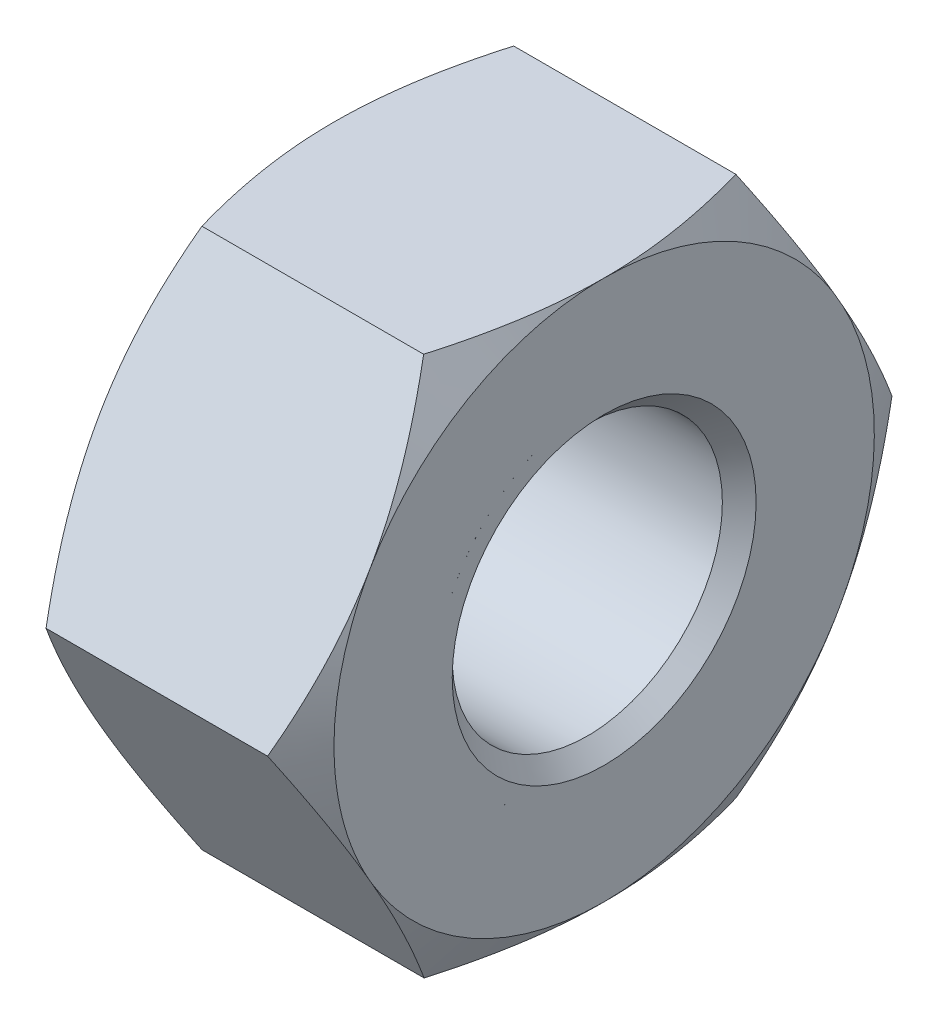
ISO-10303-21;
HEADER;
FILE_DESCRIPTION(('STEP AP214'),'2;1');
FILE_NAME('part.step','',(''),(''),'','','');
FILE_SCHEMA(('AUTOMOTIVE_DESIGN { 1 0 10303 214 1 1 1 1 }'));
ENDSEC;
DATA;
#1=APPLICATION_CONTEXT('core data for automotive mechanical design processes');
#2=APPLICATION_PROTOCOL_DEFINITION('international standard','automotive_design',2000,#1);
#3=PRODUCT_CONTEXT('',#1,'mechanical');
#4=PRODUCT('Part','Part','',(#3));
#5=PRODUCT_RELATED_PRODUCT_CATEGORY('part','',(#4));
#6=PRODUCT_DEFINITION_FORMATION('','',#4);
#7=PRODUCT_DEFINITION_CONTEXT('part definition',#1,'design');
#8=PRODUCT_DEFINITION('design','',#6,#7);
#9=PRODUCT_DEFINITION_SHAPE('','',#8);
#10=(LENGTH_UNIT() NAMED_UNIT(*) SI_UNIT(.MILLI.,.METRE.));
#11=(NAMED_UNIT(*) PLANE_ANGLE_UNIT() SI_UNIT($,.RADIAN.));
#12=(NAMED_UNIT(*) SI_UNIT($,.STERADIAN.) SOLID_ANGLE_UNIT());
#13=UNCERTAINTY_MEASURE_WITH_UNIT(LENGTH_MEASURE(1.E-05),#10,'distance_accuracy_value','');
#14=(GEOMETRIC_REPRESENTATION_CONTEXT(3) GLOBAL_UNCERTAINTY_ASSIGNED_CONTEXT((#13)) GLOBAL_UNIT_ASSIGNED_CONTEXT((#10,
#11,#12)) REPRESENTATION_CONTEXT('',''));
#15=CARTESIAN_POINT('',(0.,0.,0.));
#16=DIRECTION('',(0.,0.,1.));
#17=DIRECTION('',(1.,0.,0.));
#18=AXIS2_PLACEMENT_3D('',#15,#16,#17);
#19=CARTESIAN_POINT('',(-8.,0.,0.));
#20=DIRECTION('',(1.,0.,0.));
#21=DIRECTION('',(0.,0.,-1.));
#22=AXIS2_PLACEMENT_3D('',#19,#20,#21);
#23=CYLINDRICAL_SURFACE('',#22,5.);
#24=CARTESIAN_POINT('',(0.,0.,0.));
#25=DIRECTION('',(1.,0.,0.));
#26=DIRECTION('',(0.,0.,-1.));
#27=AXIS2_PLACEMENT_3D('',#24,#25,#26);
#28=CIRCLE('',#27,5.);
#29=CARTESIAN_POINT('',(0.,0.,-5.));
#30=VERTEX_POINT('',#29);
#31=EDGE_CURVE('P0_E15',#30,#30,#28,.F.);
#32=ORIENTED_EDGE('',*,*,#31,.T.);
#33=EDGE_LOOP('',(#32));
#34=FACE_BOUND('',#33,.T.);
#35=CARTESIAN_POINT('',(-8.,0.,0.));
#36=DIRECTION('',(1.,0.,0.));
#37=DIRECTION('',(0.,0.,-1.));
#38=AXIS2_PLACEMENT_3D('',#35,#36,#37);
#39=CIRCLE('',#38,5.);
#40=CARTESIAN_POINT('',(-8.,0.,-5.));
#41=VERTEX_POINT('',#40);
#42=EDGE_CURVE('P0_E10',#41,#41,#39,.T.);
#43=ORIENTED_EDGE('',*,*,#42,.T.);
#44=EDGE_LOOP('',(#43));
#45=FACE_BOUND('',#44,.T.);
#46=ADVANCED_FACE('P0_F14',(#34,#45),#23,.T.);
#47=OPEN_SHELL('',(#46));
#48=SHELL_BASED_SURFACE_MODEL('P0_B1',(#47));
#49=CARTESIAN_POINT('',(-8.,0.,0.));
#50=DIRECTION('',(-1.,0.,0.));
#51=DIRECTION('',(0.,0.,1.));
#52=AXIS2_PLACEMENT_3D('',#49,#50,#51);
#53=PLANE('',#52);
#54=CARTESIAN_POINT('',(-8.,-4.5,0.));
#55=CARTESIAN_POINT('',(-8.,-4.49979761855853,-0.858589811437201));
#56=CARTESIAN_POINT('',(-8.,-4.18404735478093,-1.65642619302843));
#57=CARTESIAN_POINT('',(-8.,-4.01636200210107,-2.08013280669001));
#58=CARTESIAN_POINT('',(-8.,-3.76647980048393,-2.46244389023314));
#59=CARTESIAN_POINT('',(-8.,-3.51182462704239,-2.85205745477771));
#60=CARTESIAN_POINT('',(-8.,-3.18198051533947,-3.18198051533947));
#61=CARTESIAN_POINT('',(-8.,-2.85289375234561,-3.5111460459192));
#62=CARTESIAN_POINT('',(-8.,-2.46244389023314,-3.76647980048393));
#63=CARTESIAN_POINT('',(-8.,-2.08106986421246,-4.01587843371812));
#64=CARTESIAN_POINT('',(-8.,-1.65642619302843,-4.18404735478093));
#65=CARTESIAN_POINT('',(-8.,-0.858869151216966,-4.49989877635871));
#66=CARTESIAN_POINT('',(-8.,0.,-4.5));
#67=CARTESIAN_POINT('',(-8.,0.857822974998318,-4.50010110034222));
#68=CARTESIAN_POINT('',(-8.,1.65642619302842,-4.18404735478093));
#69=CARTESIAN_POINT('',(-8.,2.08013280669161,-4.01636200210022));
#70=CARTESIAN_POINT('',(-8.,2.46244389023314,-3.76647980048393));
#71=CARTESIAN_POINT('',(-8.,2.85205745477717,-3.51182462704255));
#72=CARTESIAN_POINT('',(-8.,3.18198051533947,-3.18198051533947));
#73=CARTESIAN_POINT('',(-8.,3.51114604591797,-2.85289375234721));
#74=CARTESIAN_POINT('',(-8.,3.76647980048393,-2.46244389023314));
#75=CARTESIAN_POINT('',(-8.,4.01587843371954,-2.08106986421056));
#76=CARTESIAN_POINT('',(-8.,4.18404735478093,-1.65642619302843));
#77=CARTESIAN_POINT('',(-8.,4.49979749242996,-0.859124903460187));
#78=CARTESIAN_POINT('',(-8.,4.5,0.));
#79=B_SPLINE_CURVE_WITH_KNOTS('',2,(#54,#55,#56,#57,#58,#59,#60,#61,#62,#63,#64,#65,#66,#67,#68,
#69,#70,#71,#72,#73,#74,#75,#76,#77,#78),.UNSPECIFIED.,.F.,.F.,(3,2,2,2,2,2,2,2,2,2,2,2,3),(0.,
0.125,0.1875,0.25,0.3125,0.375,0.5,0.625,0.6875,0.75,0.8125,0.875,1.),.UNSPECIFIED.);
#80=CARTESIAN_POINT('',(-8.00000000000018,-4.49999999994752,0.));
#81=VERTEX_POINT('',#80);
#82=CARTESIAN_POINT('',(-8.00000000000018,4.49999999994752,0.));
#83=VERTEX_POINT('',#82);
#84=EDGE_CURVE('P1_E778',#81,#83,#79,.T.);
#85=ORIENTED_EDGE('',*,*,#84,.T.);
#86=CARTESIAN_POINT('',(-8.,4.5,0.));
#87=CARTESIAN_POINT('',(-8.,4.49979761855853,0.858589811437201));
#88=CARTESIAN_POINT('',(-8.,4.18404735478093,1.65642619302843));
#89=CARTESIAN_POINT('',(-8.,4.01636200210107,2.08013280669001));
#90=CARTESIAN_POINT('',(-8.,3.76647980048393,2.46244389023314));
#91=CARTESIAN_POINT('',(-8.,3.51182462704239,2.85205745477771));
#92=CARTESIAN_POINT('',(-8.,3.18198051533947,3.18198051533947));
#93=CARTESIAN_POINT('',(-8.,2.85289375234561,3.5111460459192));
#94=CARTESIAN_POINT('',(-8.,2.46244389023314,3.76647980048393));
#95=CARTESIAN_POINT('',(-8.,2.08106986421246,4.01587843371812));
#96=CARTESIAN_POINT('',(-8.,1.65642619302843,4.18404735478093));
#97=CARTESIAN_POINT('',(-8.,0.858869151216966,4.49989877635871));
#98=CARTESIAN_POINT('',(-8.,0.,4.5));
#99=CARTESIAN_POINT('',(-8.,-0.857822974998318,4.50010110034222));
#100=CARTESIAN_POINT('',(-8.,-1.65642619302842,4.18404735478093));
#101=CARTESIAN_POINT('',(-8.,-2.08013280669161,4.01636200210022));
#102=CARTESIAN_POINT('',(-8.,-2.46244389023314,3.76647980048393));
#103=CARTESIAN_POINT('',(-8.,-2.85205745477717,3.51182462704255));
#104=CARTESIAN_POINT('',(-8.,-3.18198051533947,3.18198051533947));
#105=CARTESIAN_POINT('',(-8.,-3.51114604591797,2.85289375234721));
#106=CARTESIAN_POINT('',(-8.,-3.76647980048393,2.46244389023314));
#107=CARTESIAN_POINT('',(-8.,-4.01587843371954,2.08106986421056));
#108=CARTESIAN_POINT('',(-8.,-4.18404735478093,1.65642619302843));
#109=CARTESIAN_POINT('',(-8.,-4.49979749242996,0.859124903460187));
#110=CARTESIAN_POINT('',(-8.,-4.5,0.));
#111=B_SPLINE_CURVE_WITH_KNOTS('',2,(#86,#87,#88,#89,#90,#91,#92,#93,#94,#95,#96,#97,#98,#99,
#100,#101,#102,#103,#104,#105,#106,#107,#108,#109,#110),.UNSPECIFIED.,.F.,.F.,(3,2,2,2,2,2,2,2,
2,2,2,2,3),(0.,0.125,0.1875,0.25,0.3125,0.375,0.5,0.625,0.6875,0.75,0.8125,0.875,1.),.UNSPECIFIED.);
#112=EDGE_CURVE('P1_E479',#83,#81,#111,.T.);
#113=ORIENTED_EDGE('',*,*,#112,.T.);
#114=EDGE_LOOP('',(#85,#113));
#115=FACE_BOUND('',#114,.T.);
#116=CARTESIAN_POINT('',(-7.99999999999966,7.99999999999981,4.23460808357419E-11));
#117=CARTESIAN_POINT('',(-7.99999065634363,8.00001673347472,0.0873041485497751));
#118=CARTESIAN_POINT('',(-7.99998131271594,7.99860325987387,0.174608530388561));
#119=CARTESIAN_POINT('',(-7.99996262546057,7.99291982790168,0.349124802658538));
#120=CARTESIAN_POINT('',(-7.99995328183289,7.98864985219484,0.436336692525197));
#121=CARTESIAN_POINT('',(-7.99993459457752,7.97725731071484,0.610574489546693));
#122=CARTESIAN_POINT('',(-7.99992525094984,7.97013472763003,0.697600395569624));
#123=CARTESIAN_POINT('',(-7.99990656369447,7.95304474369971,0.871372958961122));
#124=CARTESIAN_POINT('',(-7.99989722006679,7.94307732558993,0.958119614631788));
#125=CARTESIAN_POINT('',(-7.99987853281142,7.92030827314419,1.13124070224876));
#126=CARTESIAN_POINT('',(-7.99986918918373,7.9075066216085,1.21761513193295));
#127=CARTESIAN_POINT('',(-7.99985050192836,7.87908280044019,1.38989919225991));
#128=CARTESIAN_POINT('',(-7.99984115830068,7.86346061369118,1.47580882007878));
#129=CARTESIAN_POINT('',(-7.99982247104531,7.82941242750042,1.64707119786));
#130=CARTESIAN_POINT('',(-7.99981312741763,7.81098641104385,1.73242394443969));
#131=CARTESIAN_POINT('',(-7.99979444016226,7.77135028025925,1.90248107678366));
#132=CARTESIAN_POINT('',(-7.99978509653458,7.75014014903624,1.98718545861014));
#133=CARTESIAN_POINT('',(-7.99976640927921,7.70495848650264,2.1558550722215));
#134=CARTESIAN_POINT('',(-7.99975706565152,7.68098693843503,2.23982029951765));
#135=CARTESIAN_POINT('',(-7.99973837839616,7.63030810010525,2.40692160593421));
#136=CARTESIAN_POINT('',(-7.99972903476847,7.60360079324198,2.49005768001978));
#137=CARTESIAN_POINT('',(-7.9997103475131,7.54747902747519,2.65541156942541));
#138=CARTESIAN_POINT('',(-7.99970100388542,7.51806455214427,2.73762937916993));
#139=CARTESIAN_POINT('',(-7.99968231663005,7.456559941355,2.90105861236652));
#140=CARTESIAN_POINT('',(-7.99967297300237,7.42446978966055,2.98227002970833));
#141=CARTESIAN_POINT('',(-7.999654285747,7.35764818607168,3.1435994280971));
#142=CARTESIAN_POINT('',(-7.99964494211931,7.32291671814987,3.22371740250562));
#143=CARTESIAN_POINT('',(-7.99962625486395,7.25084967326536,3.3827740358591));
#144=CARTESIAN_POINT('',(-7.99961691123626,7.21351408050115,3.46171268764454));
#145=CARTESIAN_POINT('',(-7.99959822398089,7.13627876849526,3.61832605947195));
#146=CARTESIAN_POINT('',(-7.99958888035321,7.0963790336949,3.69600077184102));
#147=CARTESIAN_POINT('',(-7.99957019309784,7.01405816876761,3.85000300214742));
#148=CARTESIAN_POINT('',(-7.99956084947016,6.97163702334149,3.92633051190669));
#149=CARTESIAN_POINT('',(-7.99954216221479,6.88431877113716,4.07755651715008));
#150=CARTESIAN_POINT('',(-7.9995328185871,6.83942164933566,4.15245500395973));
#151=CARTESIAN_POINT('',(-7.99951413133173,6.74719953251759,4.30074267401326));
#152=CARTESIAN_POINT('',(-7.99950478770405,6.69987452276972,4.37413184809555));
#153=CARTESIAN_POINT('',(-7.99948610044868,6.60284732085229,4.51932222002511));
#154=CARTESIAN_POINT('',(-7.999476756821,6.55314511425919,4.5911234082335));
#155=CARTESIAN_POINT('',(-7.99945806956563,6.45141675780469,4.73306083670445));
#156=CARTESIAN_POINT('',(-7.99944872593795,6.39939059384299,4.80319706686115));
#157=CARTESIAN_POINT('',(-7.99943003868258,6.2930700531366,4.94172939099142));
#158=CARTESIAN_POINT('',(-7.9994206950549,6.23877566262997,5.01012547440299));
#159=CARTESIAN_POINT('',(-7.99940200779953,6.12797683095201,5.1451041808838));
#160=CARTESIAN_POINT('',(-7.99939266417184,6.07147237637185,5.21168679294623));
#161=CARTESIAN_POINT('',(-7.99937397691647,5.95631394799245,5.34296717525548));
#162=CARTESIAN_POINT('',(-7.99936463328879,5.89765996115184,5.40766493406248));
#163=CARTESIAN_POINT('',(-7.99934594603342,5.77826530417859,5.53510624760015));
#164=CARTESIAN_POINT('',(-7.99933660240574,5.71752462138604,5.59784979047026));
#165=CARTESIAN_POINT('',(-7.99931791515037,5.59402164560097,5.72131540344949));
#166=CARTESIAN_POINT('',(-7.99930857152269,5.53125934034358,5.78203746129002));
#167=CARTESIAN_POINT('',(-7.99928988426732,5.40378036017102,5.90139500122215));
#168=CARTESIAN_POINT('',(-7.99928054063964,5.33906367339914,5.96003047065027));
#169=CARTESIAN_POINT('',(-7.99926185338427,5.20774526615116,6.07515196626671));
#170=CARTESIAN_POINT('',(-7.99925250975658,5.1411435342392,6.13163797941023));
#171=CARTESIAN_POINT('',(-7.99923382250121,5.00612639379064,6.24239999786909));
#172=CARTESIAN_POINT('',(-7.99922447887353,4.93771097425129,6.29667598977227));
#173=CARTESIAN_POINT('',(-7.99920579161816,4.79913976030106,6.40295976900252));
#174=CARTESIAN_POINT('',(-7.99919644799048,4.72898395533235,6.45496754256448));
#175=CARTESIAN_POINT('',(-7.99917776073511,4.58700713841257,6.55665911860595));
#176=CARTESIAN_POINT('',(-7.99916841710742,4.5151861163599,6.60634290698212));
#177=CARTESIAN_POINT('',(-7.99914972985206,4.36995581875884,6.70333323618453));
#178=CARTESIAN_POINT('',(-7.99914038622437,4.29654653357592,6.75063976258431));
#179=CARTESIAN_POINT('',(-7.999121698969,4.14821836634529,6.84282483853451));
#180=CARTESIAN_POINT('',(-7.99911235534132,4.07329947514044,6.88770337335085));
#181=CARTESIAN_POINT('',(-7.99909366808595,3.9220323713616,6.97498433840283));
#182=CARTESIAN_POINT('',(-7.99908432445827,3.84568415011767,7.01738675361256));
#183=CARTESIAN_POINT('',(-7.9990656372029,3.69164019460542,7.09967000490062));
#184=CARTESIAN_POINT('',(-7.99905629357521,3.61394445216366,7.13955082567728));
#185=CARTESIAN_POINT('',(-7.99903760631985,3.45728870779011,7.21674811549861));
#186=CARTESIAN_POINT('',(-7.99902826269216,3.37832869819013,7.25406456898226));
#187=CARTESIAN_POINT('',(-7.99900957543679,3.21922902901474,7.32609309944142));
#188=CARTESIAN_POINT('',(-7.99900023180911,3.13908936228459,7.36080516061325));
#189=CARTESIAN_POINT('',(-7.99898154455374,2.97771625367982,7.42758767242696));
#190=CARTESIAN_POINT('',(-7.99897220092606,2.89648280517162,7.45965810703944));
#191=CARTESIAN_POINT('',(-7.99895351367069,2.73300918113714,7.52112296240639));
#192=CARTESIAN_POINT('',(-7.99894417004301,2.65076899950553,7.55051736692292));
#193=CARTESIAN_POINT('',(-7.99892548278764,2.48537003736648,7.60659862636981));
#194=CARTESIAN_POINT('',(-7.99891613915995,2.40221125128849,7.63328546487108));
#195=CARTESIAN_POINT('',(-7.99889745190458,2.23506419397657,7.68392295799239));
#196=CARTESIAN_POINT('',(-7.9988881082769,2.15107591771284,7.70787359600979));
#197=CARTESIAN_POINT('',(-7.99886942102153,1.98235988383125,7.7530129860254));
#198=CARTESIAN_POINT('',(-7.99886007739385,1.89763212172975,7.77420172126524));
#199=CARTESIAN_POINT('',(-7.99884139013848,1.72752791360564,7.81379456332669));
#200=CARTESIAN_POINT('',(-7.99883204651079,1.64215146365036,7.83219865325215));
#201=CARTESIAN_POINT('',(-7.99881335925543,1.47084137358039,7.86620244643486));
#202=CARTESIAN_POINT('',(-7.99880401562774,1.3849077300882,7.88180213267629));
#203=CARTESIAN_POINT('',(-7.99878532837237,1.21257534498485,7.91018036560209));
#204=CARTESIAN_POINT('',(-7.99877598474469,1.12617660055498,7.92295889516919));
#205=CARTESIAN_POINT('',(-7.99875729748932,0.953006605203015,7.94568108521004));
#206=CARTESIAN_POINT('',(-7.99874795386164,0.866235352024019,7.95562472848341));
#207=CARTESIAN_POINT('',(-7.99872926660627,0.69241333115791,7.97266645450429));
#208=CARTESIAN_POINT('',(-7.99871992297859,0.605362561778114,7.97976451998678));
#209=CARTESIAN_POINT('',(-7.99870123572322,0.431074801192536,7.99110744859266));
#210=CARTESIAN_POINT('',(-7.99869189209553,0.343837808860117,7.99535229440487));
#211=CARTESIAN_POINT('',(-7.99867320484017,0.169271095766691,8.00098419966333));
#212=CARTESIAN_POINT('',(-7.99866386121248,0.0819413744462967,8.0023712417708));
#213=CARTESIAN_POINT('',(-7.99864517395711,-0.0927172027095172,8.00228601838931));
#214=CARTESIAN_POINT('',(-7.99863583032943,-0.180046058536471,8.00081373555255));
#215=CARTESIAN_POINT('',(-7.99861714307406,-0.354609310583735,7.99501140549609));
#216=CARTESIAN_POINT('',(-7.99860779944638,-0.441843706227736,7.99068134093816));
#217=CARTESIAN_POINT('',(-7.99858911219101,-0.616124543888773,7.97916805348));
#218=CARTESIAN_POINT('',(-7.99857976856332,-0.703170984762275,7.9719848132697));
#219=CARTESIAN_POINT('',(-7.99856108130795,-0.876982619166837,7.95477283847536));
#220=CARTESIAN_POINT('',(-7.99855173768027,-0.963747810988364,7.94474408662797));
#221=CARTESIAN_POINT('',(-7.9985330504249,-1.13690395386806,7.92185180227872));
#222=CARTESIAN_POINT('',(-7.99852370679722,-1.22329490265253,7.90898825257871));
#223=CARTESIAN_POINT('',(-7.99850501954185,-1.39560996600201,7.88044012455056));
#224=CARTESIAN_POINT('',(-7.99849567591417,-1.48153407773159,7.86475552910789));
#225=CARTESIAN_POINT('',(-7.9984769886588,-1.6528233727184,7.83058208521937));
#226=CARTESIAN_POINT('',(-7.99846764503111,-1.73818855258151,7.81209321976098));
#227=CARTESIAN_POINT('',(-7.99844895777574,-1.90826848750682,7.77233101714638));
#228=CARTESIAN_POINT('',(-7.99843961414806,-1.99298323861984,7.75105766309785));
#229=CARTESIAN_POINT('',(-7.99842092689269,-2.16167151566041,7.70574924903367));
#230=CARTESIAN_POINT('',(-7.99841158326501,-2.24564503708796,7.68171417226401));
#231=CARTESIAN_POINT('',(-7.99839289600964,-2.41276084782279,7.63090803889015));
#232=CARTESIAN_POINT('',(-7.99838355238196,-2.49590313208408,7.60413696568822));
#233=CARTESIAN_POINT('',(-7.99836486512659,-2.66126735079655,7.54788749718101));
#234=CARTESIAN_POINT('',(-7.99835552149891,-2.74348927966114,7.51840908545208));
#235=CARTESIAN_POINT('',(-7.99833683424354,-2.90692465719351,7.45677650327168));
#236=CARTESIAN_POINT('',(-7.99832749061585,-2.98813809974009,7.42462231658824));
#237=CARTESIAN_POINT('',(-7.99830880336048,-3.14946944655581,7.35767260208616));
#238=CARTESIAN_POINT('',(-7.9982994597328,-3.22958734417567,7.32287705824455));
#239=CARTESIAN_POINT('',(-7.99828077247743,-3.38864174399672,7.25068193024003));
#240=CARTESIAN_POINT('',(-7.99827142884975,-3.46757823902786,7.21328233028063));
#241=CARTESIAN_POINT('',(-7.99825274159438,-3.62418513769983,7.13591898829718));
#242=CARTESIAN_POINT('',(-7.99824339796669,-3.70185553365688,7.09595523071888));
#243=CARTESIAN_POINT('',(-7.99822471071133,-3.85584728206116,7.01350694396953));
#244=CARTESIAN_POINT('',(-7.99821536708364,-3.93216862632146,6.97102239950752));
#245=CARTESIAN_POINT('',(-7.9982060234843,-4.00777374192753,6.92729928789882));
#246=B_SPLINE_CURVE_WITH_KNOTS('',3,(#116,#117,#118,#119,#120,#121,#122,#123,#124,#125,#126,
#127,#128,#129,#130,#131,#132,#133,#134,#135,#136,#137,#138,#139,#140,#141,#142,#143,#144,#145,
#146,#147,#148,#149,#150,#151,#152,#153,#154,#155,#156,#157,#158,#159,#160,#161,#162,#163,#164,
#165,#166,#167,#168,#169,#170,#171,#172,#173,#174,#175,#176,#177,#178,#179,#180,#181,#182,#183,
#184,#185,#186,#187,#188,#189,#190,#191,#192,#193,#194,#195,#196,#197,#198,#199,#200,#201,#202,
#203,#204,#205,#206,#207,#208,#209,#210,#211,#212,#213,#214,#215,#216,#217,#218,#219,#220,#221,
#222,#223,#224,#225,#226,#227,#228,#229,#230,#231,#232,#233,#234,#235,#236,#237,#238,#239,#240,
#241,#242,#243,#244,#245),.UNSPECIFIED.,.F.,.F.,(4,2,2,2,2,2,2,2,2,2,2,2,2,2,2,2,2,2,2,2,2,2,2,
2,2,2,2,2,2,2,2,2,2,2,2,2,2,2,2,2,2,2,2,2,2,2,2,2,2,2,2,2,2,2,2,2,2,2,2,2,2,2,2,2,4),(0.,
0.261900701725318,0.523802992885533,0.785706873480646,1.04761234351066,1.30951940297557,
1.57142805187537,1.83333829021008,2.09525011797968,2.35716353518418,2.61907854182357,
2.88099513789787,3.14291332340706,3.40483309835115,3.66675446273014,3.92867741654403,
4.19060195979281,4.45252809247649,4.71445581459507,4.97638512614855,5.23831602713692,
5.5002485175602,5.76218259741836,6.02411826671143,6.2860555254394,6.54799437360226,
6.80993481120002,7.07187683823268,7.33382045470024,7.5957656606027,7.85771245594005,
8.1196608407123,8.38161081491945,8.64356237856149,8.90551553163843,9.16747027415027,
9.42942660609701,9.69138452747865,9.95334403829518,10.2153051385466,10.4772678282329,
10.7392321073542,11.0011979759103,11.2631654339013,11.5251344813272,11.7871051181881,
12.0490773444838,12.3110511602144,12.5730265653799,12.8350035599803,13.0969821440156,
13.3589623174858,13.6209440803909,13.8829274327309,14.1449123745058,14.4068989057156,
14.6688870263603,14.9308767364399,15.1928680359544,15.4548609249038,15.7168554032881,
15.9788514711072,16.2408491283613,16.5028483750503,16.7648492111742),.UNSPECIFIED.);
#247=CARTESIAN_POINT('',(-8.,8.,4.23574916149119E-11));
#248=VERTEX_POINT('',#247);
#249=CARTESIAN_POINT('',(-7.99888745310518,-4.00803738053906,6.92761655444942));
#250=VERTEX_POINT('',#249);
#251=EDGE_CURVE('P1_E145',#248,#250,#246,.T.);
#252=ORIENTED_EDGE('',*,*,#251,.F.);
#253=CARTESIAN_POINT('',(-8.0000000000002,0.,0.));
#254=DIRECTION('',(1.,0.,0.));
#255=DIRECTION('',(0.,0.534138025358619,-0.845397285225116));
#256=AXIS2_PLACEMENT_3D('',#253,#254,#255);
#257=CIRCLE('',#256,8.00000000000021);
#258=CARTESIAN_POINT('',(-8.00000000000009,4.27310420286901,-6.76317828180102));
#259=VERTEX_POINT('',#258);
#260=EDGE_CURVE('P1_E142',#259,#248,#257,.T.);
#261=ORIENTED_EDGE('',*,*,#260,.F.);
#262=DIRECTION('',(0.,-0.865800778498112,-0.500388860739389));
#263=VECTOR('',#262,1.);
#264=CARTESIAN_POINT('',(-8.,4.273104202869,-6.763178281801));
#265=LINE('',#264,#263);
#266=CARTESIAN_POINT('',(-8.00000000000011,3.72689149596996,-7.07886147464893));
#267=VERTEX_POINT('',#266);
#268=EDGE_CURVE('P1_E125',#259,#267,#265,.T.);
#269=ORIENTED_EDGE('',*,*,#268,.T.);
#270=CARTESIAN_POINT('',(-8.00000000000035,0.,0.));
#271=DIRECTION('',(1.,0.,0.));
#272=DIRECTION('',(0.,-0.479752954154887,-0.877403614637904));
#273=AXIS2_PLACEMENT_3D('',#270,#271,#272);
#274=CIRCLE('',#273,7.99999999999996);
#275=CARTESIAN_POINT('',(-8.00000000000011,-3.8380236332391,-7.01922891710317));
#276=VERTEX_POINT('',#275);
#277=EDGE_CURVE('P1_E705',#276,#267,#274,.T.);
#278=ORIENTED_EDGE('',*,*,#277,.F.);
#279=DIRECTION('',(0.,-0.866249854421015,0.499611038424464));
#280=VECTOR('',#279,1.);
#281=CARTESIAN_POINT('',(-8.,-3.838023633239,-7.019228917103));
#282=LINE('',#281,#280);
#283=CARTESIAN_POINT('',(-8.00000000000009,-4.1536795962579,-6.83717381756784));
#284=VERTEX_POINT('',#283);
#285=EDGE_CURVE('P1_E139',#276,#284,#282,.T.);
#286=ORIENTED_EDGE('',*,*,#285,.T.);
#287=CARTESIAN_POINT('',(-8.00000000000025,0.,0.));
#288=DIRECTION('',(1.,0.,0.));
#289=DIRECTION('',(0.,-1.,0.));
#290=AXIS2_PLACEMENT_3D('',#287,#288,#289);
#291=CIRCLE('',#290,8.00000000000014);
#292=CARTESIAN_POINT('',(-8.,-8.,1.67025312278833E-11));
#293=VERTEX_POINT('',#292);
#294=EDGE_CURVE('P1_E219',#293,#284,#291,.T.);
#295=ORIENTED_EDGE('',*,*,#294,.F.);
#296=CARTESIAN_POINT('',(-7.99820624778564,-4.00827287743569,6.92701004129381));
#297=CARTESIAN_POINT('',(-7.9982249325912,-4.08374848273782,6.8832997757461));
#298=CARTESIAN_POINT('',(-7.99824361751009,-4.15850897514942,6.8383547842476));
#299=CARTESIAN_POINT('',(-7.99828098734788,-4.30652018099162,6.74604595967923));
#300=CARTESIAN_POINT('',(-7.99829967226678,-4.37977091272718,6.69868215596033));
#301=CARTESIAN_POINT('',(-7.99833704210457,-4.52468400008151,6.60158584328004));
#302=CARTESIAN_POINT('',(-7.99835572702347,-4.59634637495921,6.55185336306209));
#303=CARTESIAN_POINT('',(-7.99839309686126,-4.73800628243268,6.45007305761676));
#304=CARTESIAN_POINT('',(-7.99841178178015,-4.80800383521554,6.39802526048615));
#305=CARTESIAN_POINT('',(-7.99844915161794,-4.94625929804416,6.29166996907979));
#306=CARTESIAN_POINT('',(-7.99846783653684,-5.01451722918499,6.23736250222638));
#307=CARTESIAN_POINT('',(-7.99850520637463,-5.14922054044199,6.12654598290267));
#308=CARTESIAN_POINT('',(-7.99852389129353,-5.21566594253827,6.07003695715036));
#309=CARTESIAN_POINT('',(-7.99856126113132,-5.34667321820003,5.95487776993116));
#310=CARTESIAN_POINT('',(-7.99857994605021,-5.41123511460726,5.89622763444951));
#311=CARTESIAN_POINT('',(-7.998617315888,-5.5384064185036,5.77684896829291));
#312=CARTESIAN_POINT('',(-7.9986360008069,-5.60101584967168,5.71612046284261));
#313=CARTESIAN_POINT('',(-7.99867337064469,-5.72421535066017,5.5926500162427));
#314=CARTESIAN_POINT('',(-7.99869205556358,-5.78480544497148,5.52990809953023));
#315=CARTESIAN_POINT('',(-7.99872942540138,-5.90390155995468,5.40247794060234));
#316=CARTESIAN_POINT('',(-7.99874811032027,-5.9624076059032,5.33778972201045));
#317=CARTESIAN_POINT('',(-7.99878548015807,-6.07727314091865,5.2065361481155));
#318=CARTESIAN_POINT('',(-7.99880416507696,-6.1336326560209,5.13997081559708));
#319=CARTESIAN_POINT('',(-7.99884153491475,-6.24414494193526,5.00503420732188));
#320=CARTESIAN_POINT('',(-7.99886021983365,-6.29829773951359,4.9366629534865));
#321=CARTESIAN_POINT('',(-7.99889758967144,-6.40433876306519,4.79818762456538));
#322=CARTESIAN_POINT('',(-7.99891627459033,-6.45622701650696,4.72808357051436));
#323=CARTESIAN_POINT('',(-7.99895364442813,-6.55768354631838,4.58621761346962));
#324=CARTESIAN_POINT('',(-7.99897232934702,-6.60725185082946,4.51445573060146));
#325=CARTESIAN_POINT('',(-7.99900969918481,-6.70401555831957,4.36935085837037));
#326=CARTESIAN_POINT('',(-7.99902838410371,-6.75121099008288,4.29600788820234));
#327=CARTESIAN_POINT('',(-7.9990657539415,-6.84317856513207,4.14781927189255));
#328=CARTESIAN_POINT('',(-7.99908443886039,-6.8879507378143,4.07297364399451));
#329=CARTESIAN_POINT('',(-7.99912180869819,-6.97502399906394,3.92185974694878));
#330=CARTESIAN_POINT('',(-7.99914049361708,-7.01732511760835,3.84559149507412));
#331=CARTESIAN_POINT('',(-7.99917786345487,-7.09941111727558,3.69171390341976));
#332=CARTESIAN_POINT('',(-7.99919654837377,-7.13919602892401,3.61410457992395));
#333=CARTESIAN_POINT('',(-7.99923391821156,-7.21620715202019,3.45762782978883));
#334=CARTESIAN_POINT('',(-7.99925260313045,-7.25343339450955,3.37876041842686));
#335=CARTESIAN_POINT('',(-7.99928997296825,-7.32528745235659,3.21985182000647));
#336=CARTESIAN_POINT('',(-7.99930865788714,-7.35991529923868,3.13981064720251));
#337=CARTESIAN_POINT('',(-7.99934602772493,-7.42653561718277,2.97864010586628));
#338=CARTESIAN_POINT('',(-7.99936471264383,-7.45852812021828,2.89751075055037));
#339=CARTESIAN_POINT('',(-7.99940208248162,-7.51984361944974,2.73425058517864));
#340=CARTESIAN_POINT('',(-7.99942076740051,-7.54916664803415,2.65211978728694));
#341=CARTESIAN_POINT('',(-7.9994581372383,-7.60511192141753,2.48694454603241));
#342=CARTESIAN_POINT('',(-7.9994768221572,-7.63173419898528,2.40390011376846));
#343=CARTESIAN_POINT('',(-7.99951419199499,-7.68224958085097,2.23698638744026));
#344=CARTESIAN_POINT('',(-7.99953287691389,-7.706142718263,2.1531171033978));
#345=CARTESIAN_POINT('',(-7.99957024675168,-7.75117434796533,1.98464333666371));
#346=CARTESIAN_POINT('',(-7.99958893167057,-7.77231287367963,1.90003886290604));
#347=CARTESIAN_POINT('',(-7.99962630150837,-7.81181275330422,1.7301851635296));
#348=CARTESIAN_POINT('',(-7.99964498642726,-7.83017414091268,1.64493594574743));
#349=CARTESIAN_POINT('',(-7.99968235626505,-7.86410018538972,1.47388389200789));
#350=CARTESIAN_POINT('',(-7.99970104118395,-7.87966487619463,1.38808106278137));
#351=CARTESIAN_POINT('',(-7.99973841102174,-7.90798096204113,1.21601350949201));
#352=CARTESIAN_POINT('',(-7.99975709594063,-7.92073239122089,1.12974879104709));
#353=CARTESIAN_POINT('',(-7.99979446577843,-7.94340838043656,0.956849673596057));
#354=CARTESIAN_POINT('',(-7.99981315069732,-7.95333297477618,0.870215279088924));
#355=CARTESIAN_POINT('',(-7.99985052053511,-7.97034480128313,0.696669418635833));
#356=CARTESIAN_POINT('',(-7.99986920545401,-7.97743206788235,0.609757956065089));
#357=CARTESIAN_POINT('',(-7.9999065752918,-7.98876156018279,0.435750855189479));
#358=CARTESIAN_POINT('',(-7.99992526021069,-7.99300382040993,0.348655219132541));
#359=CARTESIAN_POINT('',(-7.99996263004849,-7.99863947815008,0.174372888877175));
#360=CARTESIAN_POINT('',(-7.99998131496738,-8.00003291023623,0.0871861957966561));
#361=CARTESIAN_POINT('',(-7.99999999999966,-7.99999999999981,0.));
#362=B_SPLINE_CURVE_WITH_KNOTS('',3,(#296,#297,#298,#299,#300,#301,#302,#303,#304,#305,#306,
#307,#308,#309,#310,#311,#312,#313,#314,#315,#316,#317,#318,#319,#320,#321,#322,#323,#324,#325,
#326,#327,#328,#329,#330,#331,#332,#333,#334,#335,#336,#337,#338,#339,#340,#341,#342,#343,#344,
#345,#346,#347,#348,#349,#350,#351,#352,#353,#354,#355,#356,#357,#358,#359,#360,#361),
.UNSPECIFIED.,.F.,.F.,(4,2,2,2,2,2,2,2,2,2,2,2,2,2,2,2,2,2,2,2,2,2,2,2,2,2,2,2,2,2,2,2,4),(0.,
0.261645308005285,0.52328744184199,0.784926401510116,1.04656218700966,1.30819479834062,
1.569824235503,1.8314504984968,2.09307358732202,2.35469350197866,2.61631024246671,
2.87792380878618,3.13953420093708,3.4011414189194,3.66274546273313,3.92434633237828,
4.18594402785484,4.44753854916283,4.70912989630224,4.97071806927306,5.23230306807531,
5.49388489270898,5.75546354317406,6.01703901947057,6.27861132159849,6.54018044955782,
6.80174640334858,7.06330918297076,7.32486878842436,7.58642521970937,7.84797847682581,
8.10952855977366,8.37107546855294),.UNSPECIFIED.);
#363=EDGE_CURVE('P1_E152',#250,#293,#362,.T.);
#364=ORIENTED_EDGE('',*,*,#363,.F.);
#365=EDGE_LOOP('',(#252,#261,#269,#278,#286,#295,#364));
#366=FACE_BOUND('',#365,.T.);
#367=ADVANCED_FACE('P1_F16',(#115,#366),#53,.T.);
#368=CARTESIAN_POINT('',(-7.28396309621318,0.,0.));
#369=DIRECTION('',(1.,0.,0.));
#370=DIRECTION('',(0.,0.,-1.));
#371=AXIS2_PLACEMENT_3D('',#368,#369,#370);
#372=CONICAL_SURFACE('',#371,9.24021229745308,1.0471975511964);
#373=CARTESIAN_POINT('',(-7.28823369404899,1.05818132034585E-13,-9.23281540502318));
#374=CARTESIAN_POINT('',(-7.61881909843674,0.990900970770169,-8.66012498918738));
#375=CARTESIAN_POINT('',(-7.79320636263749,1.8857815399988,-8.14292948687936));
#376=CARTESIAN_POINT('',(-7.9762054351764,2.82485421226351,-7.6001931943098));
#377=CARTESIAN_POINT('',(-7.99999999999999,3.72689149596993,-7.07886147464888));
#378=B_SPLINE_CURVE_WITH_KNOTS('',2,(#373,#374,#375,#376,#377),.UNSPECIFIED.,.F.,.F.,(3,2,3),
(0.,0.5,1.),.UNSPECIFIED.);
#379=CARTESIAN_POINT('',(-7.28823369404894,0.,-9.23281540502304));
#380=VERTEX_POINT('',#379);
#381=EDGE_CURVE('P1_E137',#380,#267,#378,.T.);
#382=ORIENTED_EDGE('',*,*,#381,.F.);
#383=CARTESIAN_POINT('',(-8.,-3.83802363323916,-7.01922891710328));
#384=CARTESIAN_POINT('',(-7.98571688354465,-2.90245563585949,-7.55881930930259));
#385=CARTESIAN_POINT('',(-7.80014419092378,-1.92858426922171,-8.12050123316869));
#386=CARTESIAN_POINT('',(-7.62592790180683,-1.01431044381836,-8.64781017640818));
#387=CARTESIAN_POINT('',(-7.288233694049,0.,-9.232815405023));
#388=B_SPLINE_CURVE_WITH_KNOTS('',2,(#383,#384,#385,#386,#387),.UNSPECIFIED.,.F.,.F.,(3,2,3),
(0.,0.5,1.),.UNSPECIFIED.);
#389=EDGE_CURVE('P1_E262',#276,#380,#388,.T.);
#390=ORIENTED_EDGE('',*,*,#389,.F.);
#391=ORIENTED_EDGE('',*,*,#277,.T.);
#392=EDGE_LOOP('',(#382,#390,#391));
#393=FACE_BOUND('',#392,.T.);
#394=ADVANCED_FACE('P1_F233',(#393),#372,.T.);
#395=CARTESIAN_POINT('',(-7.28118163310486,0.,0.));
#396=DIRECTION('',(1.,0.,0.));
#397=DIRECTION('',(0.,0.,-1.));
#398=AXIS2_PLACEMENT_3D('',#395,#396,#397);
#399=CONICAL_SURFACE('',#398,9.24502993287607,1.0471975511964);
#400=CARTESIAN_POINT('',(-7.285468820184,-8.00000000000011,-4.61880215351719));
#401=CARTESIAN_POINT('',(-7.62654133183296,-6.97713601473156,-5.20874065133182));
#402=CARTESIAN_POINT('',(-7.801724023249,-6.05416058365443,-5.74106826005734));
#403=CARTESIAN_POINT('',(-7.98579456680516,-5.08435821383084,-6.3004033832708));
#404=CARTESIAN_POINT('',(-8.,-4.15367959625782,-6.83717381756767));
#405=B_SPLINE_CURVE_WITH_KNOTS('',2,(#400,#401,#402,#403,#404),.UNSPECIFIED.,.F.,.F.,(3,2,3),
(0.,0.5,1.),.UNSPECIFIED.);
#406=CARTESIAN_POINT('',(-7.28546882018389,-8.,-4.61880215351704));
#407=VERTEX_POINT('',#406);
#408=EDGE_CURVE('P1_E270',#407,#284,#405,.T.);
#409=ORIENTED_EDGE('',*,*,#408,.F.);
#410=CARTESIAN_POINT('',(-8.,-8.,2.22695126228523E-11));
#411=CARTESIAN_POINT('',(-7.99991776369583,-8.,-1.12077408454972));
#412=CARTESIAN_POINT('',(-7.814823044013,-8.,-2.28793484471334));
#413=CARTESIAN_POINT('',(-7.63995351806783,-8.,-3.39061810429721));
#414=CARTESIAN_POINT('',(-7.285468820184,-8.,-4.618802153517));
#415=B_SPLINE_CURVE_WITH_KNOTS('',2,(#410,#411,#412,#413,#414),.UNSPECIFIED.,.F.,.F.,(3,2,3),
(0.,0.5,1.),.UNSPECIFIED.);
#416=EDGE_CURVE('P1_E272',#293,#407,#415,.T.);
#417=ORIENTED_EDGE('',*,*,#416,.F.);
#418=ORIENTED_EDGE('',*,*,#294,.T.);
#419=EDGE_LOOP('',(#409,#417,#418));
#420=FACE_BOUND('',#419,.T.);
#421=ADVANCED_FACE('P1_F225',(#420),#399,.T.);
#422=CARTESIAN_POINT('',(-7.28118163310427,0.,0.));
#423=DIRECTION('',(1.,0.,0.));
#424=DIRECTION('',(0.,0.,-1.));
#425=AXIS2_PLACEMENT_3D('',#422,#423,#424);
#426=CONICAL_SURFACE('',#425,9.24502993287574,1.0471975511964);
#427=CARTESIAN_POINT('',(-7.99865451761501,-4.0082924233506,6.9281958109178));
#428=CARTESIAN_POINT('',(-7.99860910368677,-4.96440672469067,6.37503798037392));
#429=CARTESIAN_POINT('',(-7.81522722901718,-5.97387307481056,5.79101343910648));
#430=CARTESIAN_POINT('',(-7.64133286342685,-6.93111331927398,5.23720419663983));
#431=CARTESIAN_POINT('',(-7.28546882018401,-8.,4.618802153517));
#432=B_SPLINE_CURVE_WITH_KNOTS('',2,(#427,#428,#429,#430,#431),.UNSPECIFIED.,.F.,.F.,(3,2,3),
(0.,0.5,1.),.UNSPECIFIED.);
#433=CARTESIAN_POINT('',(-7.28546882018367,-7.99999999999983,4.61880215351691));
#434=VERTEX_POINT('',#433);
#435=EDGE_CURVE('P1_E549',#250,#434,#432,.T.);
#436=ORIENTED_EDGE('',*,*,#435,.F.);
#437=ORIENTED_EDGE('',*,*,#363,.T.);
#438=CARTESIAN_POINT('',(-7.285468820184,-8.,4.618802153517));
#439=CARTESIAN_POINT('',(-7.63979557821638,-8.,3.39116531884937));
#440=CARTESIAN_POINT('',(-7.81482251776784,-8.,2.28793815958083));
#441=CARTESIAN_POINT('',(-7.99991772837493,-8.,1.12124882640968));
#442=CARTESIAN_POINT('',(-8.,-8.,2.22695126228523E-11));
#443=B_SPLINE_CURVE_WITH_KNOTS('',2,(#438,#439,#440,#441,#442),.UNSPECIFIED.,.F.,.F.,(3,2,3),
(0.,0.5,1.),.UNSPECIFIED.);
#444=EDGE_CURVE('P1_E249',#434,#293,#443,.T.);
#445=ORIENTED_EDGE('',*,*,#444,.F.);
#446=EDGE_LOOP('',(#436,#437,#445));
#447=FACE_BOUND('',#446,.T.);
#448=ADVANCED_FACE('P1_F181',(#447),#426,.T.);
#449=CARTESIAN_POINT('',(-7.28396165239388,0.,0.));
#450=DIRECTION('',(1.,0.,0.));
#451=DIRECTION('',(0.,0.,-1.));
#452=AXIS2_PLACEMENT_3D('',#449,#450,#451);
#453=CONICAL_SURFACE('',#452,9.24021479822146,1.0471975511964);
#454=CARTESIAN_POINT('',(-7.288232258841,8.,-4.609221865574));
#455=CARTESIAN_POINT('',(-7.64117770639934,8.,-3.38446341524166));
#456=CARTESIAN_POINT('',(-7.8155407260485,8.,-2.28340995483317));
#457=CARTESIAN_POINT('',(-7.99991784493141,8.,-1.11912027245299));
#458=CARTESIAN_POINT('',(-8.,8.,4.23593451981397E-11));
#459=B_SPLINE_CURVE_WITH_KNOTS('',2,(#454,#455,#456,#457,#458),.UNSPECIFIED.,.F.,.F.,(3,2,3),
(0.,0.5,1.),.UNSPECIFIED.);
#460=CARTESIAN_POINT('',(-7.28823225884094,8.,-4.60922186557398));
#461=VERTEX_POINT('',#460);
#462=EDGE_CURVE('P1_E157',#461,#248,#459,.T.);
#463=ORIENTED_EDGE('',*,*,#462,.F.);
#464=CARTESIAN_POINT('',(-7.99999999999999,4.27310420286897,-6.76317828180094));
#465=CARTESIAN_POINT('',(-7.97606461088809,5.1804093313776,-6.23880201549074));
#466=CARTESIAN_POINT('',(-7.7907432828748,6.12666489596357,-5.69191437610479));
#467=CARTESIAN_POINT('',(-7.61664615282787,7.01560941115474,-5.17814961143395));
#468=CARTESIAN_POINT('',(-7.28823225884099,8.,-4.609221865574));
#469=B_SPLINE_CURVE_WITH_KNOTS('',2,(#464,#465,#466,#467,#468),.UNSPECIFIED.,.F.,.F.,(3,2,3),
(0.,0.5,1.),.UNSPECIFIED.);
#470=EDGE_CURVE('P1_E132',#259,#461,#469,.T.);
#471=ORIENTED_EDGE('',*,*,#470,.F.);
#472=ORIENTED_EDGE('',*,*,#260,.T.);
#473=EDGE_LOOP('',(#463,#471,#472));
#474=FACE_BOUND('',#473,.T.);
#475=ADVANCED_FACE('P1_F156',(#474),#453,.T.);
#476=CARTESIAN_POINT('',(-7.27561721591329,0.,0.));
#477=DIRECTION('',(1.,0.,0.));
#478=DIRECTION('',(0.,0.,-1.));
#479=AXIS2_PLACEMENT_3D('',#476,#477,#478);
#480=CONICAL_SURFACE('',#479,9.25466778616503,1.0471975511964);
#481=ORIENTED_EDGE('',*,*,#251,.T.);
#482=CARTESIAN_POINT('',(-7.27993763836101,0.,9.24718459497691));
#483=CARTESIAN_POINT('',(-7.63852125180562,-1.07371012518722,8.6259919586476));
#484=CARTESIAN_POINT('',(-7.81387245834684,-2.03528315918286,8.06967599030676));
#485=CARTESIAN_POINT('',(-7.99860903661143,-3.04832273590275,7.48358416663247));
#486=CARTESIAN_POINT('',(-7.99865451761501,-4.0082924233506,6.9281958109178));
#487=B_SPLINE_CURVE_WITH_KNOTS('',2,(#482,#483,#484,#485,#486),.UNSPECIFIED.,.F.,.F.,(3,2,3),
(0.,0.5,1.),.UNSPECIFIED.);
#488=CARTESIAN_POINT('',(-7.27993763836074,0.,9.24718459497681));
#489=VERTEX_POINT('',#488);
#490=EDGE_CURVE('P1_E286',#489,#250,#487,.T.);
#491=ORIENTED_EDGE('',*,*,#490,.F.);
#492=CARTESIAN_POINT('',(-7.282701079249,7.99999999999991,4.62838244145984));
#493=CARTESIAN_POINT('',(-7.63982578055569,6.92676989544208,5.24801213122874));
#494=CARTESIAN_POINT('',(-7.81413297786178,5.96449640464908,5.80358099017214));
#495=CARTESIAN_POINT('',(-7.99548429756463,4.96333540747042,6.38160156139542));
#496=CARTESIAN_POINT('',(-7.99520320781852,4.00063118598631,6.93741910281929));
#497=CARTESIAN_POINT('',(-7.99492243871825,3.03902514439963,7.49260260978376));
#498=CARTESIAN_POINT('',(-7.81285185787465,2.03671833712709,8.07128471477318));
#499=CARTESIAN_POINT('',(-7.63808918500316,1.0746418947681,8.62673980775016));
#500=CARTESIAN_POINT('',(-7.279937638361,0.,9.247184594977));
#501=B_SPLINE_CURVE_WITH_KNOTS('',2,(#492,#493,#494,#495,#496,#497,#498,#499,#500),
.UNSPECIFIED.,.F.,.F.,(3,2,2,2,3),(0.,0.25,0.5,0.75,1.),.UNSPECIFIED.);
#502=CARTESIAN_POINT('',(-7.28270107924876,7.99999999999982,4.62838244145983));
#503=VERTEX_POINT('',#502);
#504=EDGE_CURVE('P1_E519',#503,#489,#501,.T.);
#505=ORIENTED_EDGE('',*,*,#504,.F.);
#506=CARTESIAN_POINT('',(-8.,8.,4.23593451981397E-11));
#507=CARTESIAN_POINT('',(-7.99991764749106,8.,1.12290143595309));
#508=CARTESIAN_POINT('',(-7.81410387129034,8.,2.29246085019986));
#509=CARTESIAN_POINT('',(-7.63856970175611,8.,3.39731779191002));
#510=CARTESIAN_POINT('',(-7.282701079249,8.,4.62838244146));
#511=B_SPLINE_CURVE_WITH_KNOTS('',2,(#506,#507,#508,#509,#510),.UNSPECIFIED.,.F.,.F.,(3,2,3),
(0.,0.5,1.),.UNSPECIFIED.);
#512=EDGE_CURVE('P1_E529',#248,#503,#511,.T.);
#513=ORIENTED_EDGE('',*,*,#512,.F.);
#514=EDGE_LOOP('',(#481,#491,#505,#513));
#515=FACE_BOUND('',#514,.T.);
#516=ADVANCED_FACE('P1_F180',(#515),#480,.T.);
#517=CARTESIAN_POINT('',(-7.99999999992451,0.,0.));
#518=DIRECTION('',(-1.,0.,0.));
#519=DIRECTION('',(0.,0.,1.));
#520=AXIS2_PLACEMENT_3D('',#517,#518,#519);
#521=CONICAL_SURFACE('',#520,4.49999999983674,0.785398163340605);
#522=CARTESIAN_POINT('',(-7.5,0.,0.));
#523=DIRECTION('',(1.,0.,0.));
#524=DIRECTION('',(0.,0.,-1.));
#525=AXIS2_PLACEMENT_3D('',#522,#523,#524);
#526=CIRCLE('',#525,4.);
#527=CARTESIAN_POINT('',(-7.5,0.,-4.));
#528=VERTEX_POINT('',#527);
#529=EDGE_CURVE('P1_E506',#528,#528,#526,.T.);
#530=ORIENTED_EDGE('',*,*,#529,.T.);
#531=EDGE_LOOP('',(#530));
#532=FACE_BOUND('',#531,.T.);
#533=ORIENTED_EDGE('',*,*,#84,.F.);
#534=ORIENTED_EDGE('',*,*,#112,.F.);
#535=EDGE_LOOP('',(#533,#534));
#536=FACE_BOUND('',#535,.T.);
#537=ADVANCED_FACE('P1_F761',(#532,#536),#521,.F.);
#538=CARTESIAN_POINT('',(0.,8.,-4.609221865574));
#539=DIRECTION('',(0.,0.500388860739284,-0.865800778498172));
#540=DIRECTION('',(0.,0.865800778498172,0.500388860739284));
#541=AXIS2_PLACEMENT_3D('',#538,#539,#540);
#542=PLANE('',#541);
#543=DIRECTION('',(1.,0.,0.));
#544=VECTOR('',#543,1.);
#545=CARTESIAN_POINT('',(0.,8.,-4.609221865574));
#546=LINE('',#545,#544);
#547=CARTESIAN_POINT('',(-0.711241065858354,7.99999992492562,-4.60922190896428));
#548=VERTEX_POINT('',#547);
#549=EDGE_CURVE('P1_E545',#548,#461,#546,.F.);
#550=ORIENTED_EDGE('',*,*,#549,.F.);
#551=CARTESIAN_POINT('',(0.,4.27310420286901,-6.76317828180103));
#552=CARTESIAN_POINT('',(-0.00398694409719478,4.42645456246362,-6.67450726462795));
#553=CARTESIAN_POINT('',(-0.0113639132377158,4.57970038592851,-6.58581714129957));
#554=CARTESIAN_POINT('',(-0.032738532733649,4.88561317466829,-6.40879324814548));
#555=CARTESIAN_POINT('',(-0.0467257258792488,5.038280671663,-6.32045913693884));
#556=CARTESIAN_POINT('',(-0.081310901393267,5.34435490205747,-6.14356505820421));
#557=CARTESIAN_POINT('',(-0.101960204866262,5.49775795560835,-6.05500881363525));
#558=CARTESIAN_POINT('',(-0.149780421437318,5.80641748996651,-5.87684941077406));
#559=CARTESIAN_POINT('',(-0.177054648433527,5.9616620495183,-5.78725351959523));
#560=CARTESIAN_POINT('',(-0.237381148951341,6.27114360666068,-5.60844182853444));
#561=CARTESIAN_POINT('',(-0.270430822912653,6.42538102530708,-5.51922587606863));
#562=CARTESIAN_POINT('',(-0.342484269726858,6.73518578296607,-5.34007930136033));
#563=CARTESIAN_POINT('',(-0.381568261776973,6.8907394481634,-5.25015738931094));
#564=CARTESIAN_POINT('',(-0.465645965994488,7.20396508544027,-5.06914348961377));
#565=CARTESIAN_POINT('',(-0.510742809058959,7.3616166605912,-4.9780643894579));
#566=CARTESIAN_POINT('',(-0.606833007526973,7.67972118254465,-4.79428709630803));
#567=CARTESIAN_POINT('',(-0.657944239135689,7.8401474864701,-4.70160427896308));
#568=CARTESIAN_POINT('',(-0.711240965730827,7.99999962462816,-4.60922208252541));
#569=B_SPLINE_CURVE_WITH_KNOTS('',3,(#551,#552,#553,#554,#555,#556,#557,#558,#559,#560,#561,
#562,#563,#564,#565,#566,#567,#568),.UNSPECIFIED.,.F.,.F.,(4,2,2,2,2,2,2,2,4),(0.,
0.531518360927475,1.0621986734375,1.59706877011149,2.1408860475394,2.68445917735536,
3.23600490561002,3.79865397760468,4.37516148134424),.UNSPECIFIED.);
#570=CARTESIAN_POINT('',(0.,4.27310420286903,-6.76317828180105));
#571=VERTEX_POINT('',#570);
#572=EDGE_CURVE('P1_E468',#571,#548,#569,.T.);
#573=ORIENTED_EDGE('',*,*,#572,.F.);
#574=DIRECTION('',(0.,0.865800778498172,0.500388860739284));
#575=VECTOR('',#574,1.);
#576=CARTESIAN_POINT('',(0.,8.,-4.609221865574));
#577=LINE('',#576,#575);
#578=CARTESIAN_POINT('',(0.,3.72689149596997,-7.07886147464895));
#579=VERTEX_POINT('',#578);
#580=EDGE_CURVE('P1_E472',#571,#579,#577,.F.);
#581=ORIENTED_EDGE('',*,*,#580,.T.);
#582=CARTESIAN_POINT('',(-0.711239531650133,3.75180643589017E-07,-9.23281518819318));
#583=CARTESIAN_POINT('',(-0.65795585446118,0.159809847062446,-9.1404492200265));
#584=CARTESIAN_POINT('',(-0.606856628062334,0.320166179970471,-9.04773602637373));
#585=CARTESIAN_POINT('',(-0.510787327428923,0.638132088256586,-8.86389704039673));
#586=CARTESIAN_POINT('',(-0.465699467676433,0.795715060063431,-8.77278664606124));
#587=CARTESIAN_POINT('',(-0.381636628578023,1.10885316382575,-8.59179415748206));
#588=CARTESIAN_POINT('',(-0.342558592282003,1.26438696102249,-8.50192329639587));
#589=CARTESIAN_POINT('',(-0.270513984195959,1.57420032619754,-8.32296199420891));
#590=CARTESIAN_POINT('',(-0.237467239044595,1.72846552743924,-8.23387904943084));
#591=CARTESIAN_POINT('',(-0.177128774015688,2.03790245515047,-8.0549872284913));
#592=CARTESIAN_POINT('',(-0.149842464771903,2.19307489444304,-7.9651777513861));
#593=CARTESIAN_POINT('',(-0.102001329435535,2.50161062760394,-7.78662943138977));
#594=CARTESIAN_POINT('',(-0.0813430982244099,2.65496166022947,-7.69789729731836));
#595=CARTESIAN_POINT('',(-0.0467433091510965,2.96110873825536,-7.52095855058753));
#596=CARTESIAN_POINT('',(-0.0327503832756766,3.11389971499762,-7.43275326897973));
#597=CARTESIAN_POINT('',(-0.0113674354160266,3.42007870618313,-7.25601940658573));
#598=CARTESIAN_POINT('',(-0.00398788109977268,3.57346728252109,-7.1674905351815));
#599=CARTESIAN_POINT('',(0.,3.72689149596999,-7.07886147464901));
#600=B_SPLINE_CURVE_WITH_KNOTS('',3,(#582,#583,#584,#585,#586,#587,#588,#589,#590,#591,#592,
#593,#594,#595,#596,#597,#598,#599),.UNSPECIFIED.,.F.,.F.,(4,2,2,2,2,2,2,2,4),(0.,
0.576366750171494,1.13888203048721,1.69029871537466,2.23374496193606,2.77769940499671,
3.31270057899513,3.84350909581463,4.37515630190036),.UNSPECIFIED.);
#601=CARTESIAN_POINT('',(-0.711239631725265,7.50361514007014E-08,-9.23281536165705));
#602=VERTEX_POINT('',#601);
#603=EDGE_CURVE('P1_E398',#602,#579,#600,.T.);
#604=ORIENTED_EDGE('',*,*,#603,.F.);
#605=DIRECTION('',(1.,0.,0.));
#606=VECTOR('',#605,1.);
#607=CARTESIAN_POINT('',(0.,0.,-9.232815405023));
#608=LINE('',#607,#606);
#609=EDGE_CURVE('P1_E393',#380,#602,#608,.T.);
#610=ORIENTED_EDGE('',*,*,#609,.F.);
#611=ORIENTED_EDGE('',*,*,#381,.T.);
#612=ORIENTED_EDGE('',*,*,#268,.F.);
#613=ORIENTED_EDGE('',*,*,#470,.T.);
#614=EDGE_LOOP('',(#550,#573,#581,#604,#610,#611,#612,#613));
#615=FACE_BOUND('',#614,.T.);
#616=ADVANCED_FACE('P1_F130',(#615),#542,.T.);
#617=CARTESIAN_POINT('',(0.,0.,-9.232815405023));
#618=DIRECTION('',(0.,-0.499611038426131,-0.866249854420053));
#619=DIRECTION('',(0.,0.866249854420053,-0.499611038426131));
#620=AXIS2_PLACEMENT_3D('',#617,#618,#619);
#621=PLANE('',#620);
#622=ORIENTED_EDGE('',*,*,#609,.T.);
#623=CARTESIAN_POINT('',(2.01986864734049E-13,-3.83802363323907,-7.0192289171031));
#624=CARTESIAN_POINT('',(-0.0023479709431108,-3.67996217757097,-7.11034238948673));
#625=CARTESIAN_POINT('',(-0.0082968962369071,-3.52190443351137,-7.2013617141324));
#626=CARTESIAN_POINT('',(-0.0272481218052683,-3.20653800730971,-7.38299371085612));
#627=CARTESIAN_POINT('',(-0.0402316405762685,-3.04922845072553,-7.4736068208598));
#628=CARTESIAN_POINT('',(-0.0732411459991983,-2.73407485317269,-7.65537358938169));
#629=CARTESIAN_POINT('',(-0.0933194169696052,-2.57623570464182,-7.74652618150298));
#630=CARTESIAN_POINT('',(-0.140415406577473,-2.25861414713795,-7.92998064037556));
#631=CARTESIAN_POINT('',(-0.167545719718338,-2.09884455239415,-8.02227556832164));
#632=CARTESIAN_POINT('',(-0.227964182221,-1.78020515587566,-8.20611217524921));
#633=CARTESIAN_POINT('',(-0.261247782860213,-1.62133477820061,-8.29765435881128));
#634=CARTESIAN_POINT('',(-0.334139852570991,-1.30230311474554,-8.48154557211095));
#635=CARTESIAN_POINT('',(-0.373833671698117,-1.14215691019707,-8.5738868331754));
#636=CARTESIAN_POINT('',(-0.45949475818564,-0.819701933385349,-8.75987986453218));
#637=CARTESIAN_POINT('',(-0.5055740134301,-0.657416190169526,-8.85351965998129));
#638=CARTESIAN_POINT('',(-0.603990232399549,-0.329874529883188,-9.04251267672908));
#639=CARTESIAN_POINT('',(-0.656456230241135,-0.16464762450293,-9.13784914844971));
#640=CARTESIAN_POINT('',(-0.711239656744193,0.,-9.23281540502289));
#641=B_SPLINE_CURVE_WITH_KNOTS('',3,(#623,#624,#625,#626,#627,#628,#629,#630,#631,#632,#633,
#634,#635,#636,#637,#638,#639,#640),.UNSPECIFIED.,.F.,.F.,(4,2,2,2,2,2,2,2,4),(0.,
0.547330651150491,1.09320714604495,1.64319335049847,2.20256682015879,2.76152842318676,
3.32866148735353,3.90742853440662,4.50086921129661),.UNSPECIFIED.);
#642=CARTESIAN_POINT('',(0.,-3.83802363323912,-7.01922891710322));
#643=VERTEX_POINT('',#642);
#644=EDGE_CURVE('P1_E391',#643,#602,#641,.T.);
#645=ORIENTED_EDGE('',*,*,#644,.F.);
#646=DIRECTION('',(0.,0.866249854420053,-0.499611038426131));
#647=VECTOR('',#646,1.);
#648=CARTESIAN_POINT('',(0.,0.,-9.232815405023));
#649=LINE('',#648,#647);
#650=CARTESIAN_POINT('',(0.,-4.15367959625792,-6.83717381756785));
#651=VERTEX_POINT('',#650);
#652=EDGE_CURVE('P1_E159',#643,#651,#649,.F.);
#653=ORIENTED_EDGE('',*,*,#652,.T.);
#654=CARTESIAN_POINT('',(-0.714002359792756,-7.99999962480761,-4.61880236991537));
#655=CARTESIAN_POINT('',(-0.659020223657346,-7.8350065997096,-4.71395697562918));
#656=CARTESIAN_POINT('',(-0.606360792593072,-7.66940068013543,-4.80942887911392));
#657=CARTESIAN_POINT('',(-0.507580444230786,-7.34111762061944,-4.99868378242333));
#658=CARTESIAN_POINT('',(-0.461329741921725,-7.17846972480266,-5.09244993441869));
#659=CARTESIAN_POINT('',(-0.375348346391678,-6.85536131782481,-5.27878651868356));
#660=CARTESIAN_POINT('',(-0.335504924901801,-6.69492289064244,-5.37134290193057));
#661=CARTESIAN_POINT('',(-0.262336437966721,-6.37537320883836,-5.55575485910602));
#662=CARTESIAN_POINT('',(-0.228925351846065,-6.21627636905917,-5.64760117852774));
#663=CARTESIAN_POINT('',(-0.168256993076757,-5.89690139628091,-5.83173973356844));
#664=CARTESIAN_POINT('',(-0.141007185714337,-5.73662207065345,-5.9240323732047));
#665=CARTESIAN_POINT('',(-0.0937055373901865,-5.41801947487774,-6.10751900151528));
#666=CARTESIAN_POINT('',(-0.0735401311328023,-5.25970876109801,-6.19870529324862));
#667=CARTESIAN_POINT('',(-0.0403896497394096,-4.94382144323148,-6.38089235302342));
#668=CARTESIAN_POINT('',(-0.0273518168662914,-4.78624824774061,-6.47188937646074));
#669=CARTESIAN_POINT('',(-0.00832408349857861,-4.47037175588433,-6.65432997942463));
#670=CARTESIAN_POINT('',(-0.00235313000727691,-4.31206763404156,-6.7457741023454));
#671=CARTESIAN_POINT('',(-1.04950770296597E-13,-4.15367959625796,-6.83717381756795));
#672=B_SPLINE_CURVE_WITH_KNOTS('',3,(#654,#655,#656,#657,#658,#659,#660,#661,#662,#663,#664,
#665,#666,#667,#668,#669,#670,#671),.UNSPECIFIED.,.F.,.F.,(4,2,2,2,2,2,2,2,4),(0.,
0.594739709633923,1.17472721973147,1.74301191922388,2.30306903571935,2.86380114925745,
3.41508346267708,3.96222798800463,4.51083616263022),.UNSPECIFIED.);
#673=CARTESIAN_POINT('',(-0.714002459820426,-7.99999992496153,-4.6188021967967));
#674=VERTEX_POINT('',#673);
#675=EDGE_CURVE('P1_E279',#674,#651,#672,.T.);
#676=ORIENTED_EDGE('',*,*,#675,.F.);
#677=DIRECTION('',(1.,0.,0.));
#678=VECTOR('',#677,1.);
#679=CARTESIAN_POINT('',(0.,-8.,-4.618802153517));
#680=LINE('',#679,#678);
#681=EDGE_CURVE('P1_E276',#407,#674,#680,.T.);
#682=ORIENTED_EDGE('',*,*,#681,.F.);
#683=ORIENTED_EDGE('',*,*,#408,.T.);
#684=ORIENTED_EDGE('',*,*,#285,.F.);
#685=ORIENTED_EDGE('',*,*,#389,.T.);
#686=EDGE_LOOP('',(#622,#645,#653,#676,#682,#683,#684,#685));
#687=FACE_BOUND('',#686,.T.);
#688=ADVANCED_FACE('P1_F277',(#687),#621,.T.);
#689=CARTESIAN_POINT('',(0.,-8.,-4.618802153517));
#690=DIRECTION('',(0.,-1.,0.));
#691=DIRECTION('',(0.,0.,-1.));
#692=AXIS2_PLACEMENT_3D('',#689,#690,#691);
#693=PLANE('',#692);
#694=ORIENTED_EDGE('',*,*,#681,.T.);
#695=CARTESIAN_POINT('',(2.82976767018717E-13,-7.99999999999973,-3.40790991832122E-11));
#696=CARTESIAN_POINT('',(5.95941556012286E-05,-7.99994905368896,-0.1903265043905));
#697=CARTESIAN_POINT('',(-0.00380203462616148,-7.99979996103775,-0.380651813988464));
#698=CARTESIAN_POINT('',(-0.019246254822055,-7.99952862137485,-0.760179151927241));
#699=CARTESIAN_POINT('',(-0.0307959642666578,-7.99940626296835,-0.949382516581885));
#700=CARTESIAN_POINT('',(-0.0616037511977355,-7.99940733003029,-1.32849403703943));
#701=CARTESIAN_POINT('',(-0.0809153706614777,-7.9995324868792,-1.51839781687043));
#702=CARTESIAN_POINT('',(-0.127120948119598,-7.9998138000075,-1.9006721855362));
#703=CARTESIAN_POINT('',(-0.154142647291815,-7.99997046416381,-2.09302719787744));
#704=CARTESIAN_POINT('',(-0.214930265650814,-8.00003501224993,-2.4764715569));
#705=CARTESIAN_POINT('',(-0.248689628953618,-7.99994313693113,-2.66756194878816));
#706=CARTESIAN_POINT('',(-0.323105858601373,-7.99982534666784,-3.05129359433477));
#707=CARTESIAN_POINT('',(-0.363856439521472,-7.99980041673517,-3.24391661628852));
#708=CARTESIAN_POINT('',(-0.452191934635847,-7.99981780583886,-3.6318727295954));
#709=CARTESIAN_POINT('',(-0.499903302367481,-7.99986156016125,-3.82717682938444));
#710=CARTESIAN_POINT('',(-0.602140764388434,-7.99994968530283,-4.22152935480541));
#711=CARTESIAN_POINT('',(-0.656814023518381,-7.99999404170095,-4.42053972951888));
#712=CARTESIAN_POINT('',(-0.714002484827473,-7.9999999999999,-4.61880215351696));
#713=B_SPLINE_CURVE_WITH_KNOTS('',3,(#695,#696,#697,#698,#699,#700,#701,#702,#703,#704,#705,
#706,#707,#708,#709,#710,#711,#712),.UNSPECIFIED.,.F.,.F.,(4,2,2,2,2,2,2,2,4),(0.,
0.570936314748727,1.13944628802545,1.71194708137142,2.29454661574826,2.87658200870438,
3.46713551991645,4.07019496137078,4.68924672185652),.UNSPECIFIED.);
#714=CARTESIAN_POINT('',(3.02401586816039E-13,-8.,-3.4048180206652E-11));
#715=VERTEX_POINT('',#714);
#716=EDGE_CURVE('P1_E340',#715,#674,#713,.T.);
#717=ORIENTED_EDGE('',*,*,#716,.F.);
#718=CARTESIAN_POINT('',(-0.714002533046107,-7.99999999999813,4.61880232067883));
#719=CARTESIAN_POINT('',(-0.656830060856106,-7.99999410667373,4.42059523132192));
#720=CARTESIAN_POINT('',(-0.602171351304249,-7.99994974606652,4.221640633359));
#721=CARTESIAN_POINT('',(-0.499959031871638,-7.99986151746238,3.82739843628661));
#722=CARTESIAN_POINT('',(-0.452258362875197,-7.9998176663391,3.63214886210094));
#723=CARTESIAN_POINT('',(-0.363940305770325,-7.99980003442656,3.2443014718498));
#724=CARTESIAN_POINT('',(-0.323196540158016,-7.99982481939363,3.05173263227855));
#725=CARTESIAN_POINT('',(-0.248790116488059,-7.99994269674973,2.66811003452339));
#726=CARTESIAN_POINT('',(-0.215033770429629,-8.00003479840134,2.47707450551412));
#727=CARTESIAN_POINT('',(-0.154229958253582,-7.99997080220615,2.09362808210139));
#728=CARTESIAN_POINT('',(-0.127193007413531,-7.99981431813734,1.90121551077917));
#729=CARTESIAN_POINT('',(-0.0809613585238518,-7.99953297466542,1.51882875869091));
#730=CARTESIAN_POINT('',(-0.0616387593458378,-7.99940761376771,1.32887017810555));
#731=CARTESIAN_POINT('',(-0.0308135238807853,-7.99940631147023,0.949650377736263));
#732=CARTESIAN_POINT('',(-0.0192572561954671,-7.99952863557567,0.760393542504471));
#733=CARTESIAN_POINT('',(-0.00380424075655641,-7.9997999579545,0.380759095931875));
#734=CARTESIAN_POINT('',(5.96198198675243E-05,-7.99994906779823,0.190380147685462));
#735=CARTESIAN_POINT('',(4.67941657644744E-13,-7.99999999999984,-3.40790991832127E-11));
#736=B_SPLINE_CURVE_WITH_KNOTS('',3,(#718,#719,#720,#721,#722,#723,#724,#725,#726,#727,#728,
#729,#730,#731,#732,#733,#734,#735),.UNSPECIFIED.,.F.,.F.,(4,2,2,2,2,2,2,2,4),(0.,
0.618878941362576,1.2217719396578,1.81216228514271,2.39403414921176,2.97681093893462,
3.54947851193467,4.11814966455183,4.68924686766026),.UNSPECIFIED.);
#737=CARTESIAN_POINT('',(-0.714002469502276,-7.99999992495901,4.61880223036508));
#738=VERTEX_POINT('',#737);
#739=EDGE_CURVE('P1_E300',#738,#715,#736,.T.);
#740=ORIENTED_EDGE('',*,*,#739,.F.);
#741=DIRECTION('',(1.,0.,0.));
#742=VECTOR('',#741,1.);
#743=CARTESIAN_POINT('',(0.,-8.,4.618802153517));
#744=LINE('',#743,#742);
#745=EDGE_CURVE('P1_E547',#434,#738,#744,.T.);
#746=ORIENTED_EDGE('',*,*,#745,.F.);
#747=ORIENTED_EDGE('',*,*,#444,.T.);
#748=ORIENTED_EDGE('',*,*,#416,.T.);
#749=EDGE_LOOP('',(#694,#717,#740,#746,#747,#748));
#750=FACE_BOUND('',#749,.T.);
#751=ADVANCED_FACE('P1_F361',(#750),#693,.T.);
#752=CARTESIAN_POINT('',(0.,-8.,4.618802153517));
#753=DIRECTION('',(0.,-0.500777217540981,0.865576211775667));
#754=DIRECTION('',(0.,-0.865576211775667,-0.500777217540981));
#755=AXIS2_PLACEMENT_3D('',#752,#753,#754);
#756=PLANE('',#755);
#757=ORIENTED_EDGE('',*,*,#745,.T.);
#758=CARTESIAN_POINT('',(-0.00211641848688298,-4.09173723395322,6.87869138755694));
#759=CARTESIAN_POINT('',(-0.00330217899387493,-4.25004656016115,6.78696556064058));
#760=CARTESIAN_POINT('',(-0.00816311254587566,-4.40833605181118,6.6952628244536));
#761=CARTESIAN_POINT('',(-0.0250768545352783,-4.72451115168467,6.51224005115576));
#762=CARTESIAN_POINT('',(-0.0371214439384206,-4.88239701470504,6.42091969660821));
#763=CARTESIAN_POINT('',(-0.0683933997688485,-5.19924206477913,6.23793348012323));
#764=CARTESIAN_POINT('',(-0.0876870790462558,-5.35819742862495,6.14627241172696));
#765=CARTESIAN_POINT('',(-0.1333375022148,-5.67840997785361,5.961558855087));
#766=CARTESIAN_POINT('',(-0.159822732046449,-5.83965276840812,5.86851343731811));
#767=CARTESIAN_POINT('',(-0.21973610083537,-6.16461256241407,5.68065653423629));
#768=CARTESIAN_POINT('',(-0.25330264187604,-6.32830716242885,5.58585062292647));
#769=CARTESIAN_POINT('',(-0.327192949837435,-6.65705941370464,5.39553546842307));
#770=CARTESIAN_POINT('',(-0.367608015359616,-6.82210219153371,5.3000360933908));
#771=CARTESIAN_POINT('',(-0.455124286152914,-7.15451271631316,5.10775626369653));
#772=CARTESIAN_POINT('',(-0.502347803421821,-7.32185675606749,5.01099087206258));
#773=CARTESIAN_POINT('',(-0.603464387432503,-7.65970554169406,4.81562717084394));
#774=CARTESIAN_POINT('',(-0.657499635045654,-7.83017842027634,4.71704715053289));
#775=CARTESIAN_POINT('',(-0.714002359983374,-7.9999996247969,4.61880237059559));
#776=B_SPLINE_CURVE_WITH_KNOTS('',3,(#758,#759,#760,#761,#762,#763,#764,#765,#766,#767,#768,
#769,#770,#771,#772,#773,#774,#775),.UNSPECIFIED.,.F.,.F.,(4,2,2,2,2,2,2,2,4),(0.,
0.548857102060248,1.0970874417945,1.65046003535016,2.21445629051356,2.79071196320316,
3.3753608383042,3.97225525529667,4.58476765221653),.UNSPECIFIED.);
#777=CARTESIAN_POINT('',(-0.00109191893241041,-4.09192357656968,6.87906952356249));
#778=VERTEX_POINT('',#777);
#779=EDGE_CURVE('P1_E1017',#778,#738,#776,.T.);
#780=ORIENTED_EDGE('',*,*,#779,.F.);
#781=CARTESIAN_POINT('',(-0.000824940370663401,-4.09224131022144,6.87962736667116));
#782=DIRECTION('',(0.000143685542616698,0.865576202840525,0.500777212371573));
#783=VECTOR('',#782,1.);
#784=LINE('',#781,#783);
#785=CARTESIAN_POINT('',(-0.00110791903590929,-3.89582874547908,6.99225826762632));
#786=VERTEX_POINT('',#785);
#787=EDGE_CURVE('P1_E284',#778,#786,#784,.T.);
#788=ORIENTED_EDGE('',*,*,#787,.T.);
#789=CARTESIAN_POINT('',(-0.719529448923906,0.,9.24718437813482));
#790=CARTESIAN_POINT('',(-0.663432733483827,-0.168062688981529,9.14994122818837));
#791=CARTESIAN_POINT('',(-0.609746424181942,-0.336730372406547,9.05231271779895));
#792=CARTESIAN_POINT('',(-0.509168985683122,-0.671028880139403,8.85881304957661));
#793=CARTESIAN_POINT('',(-0.46214049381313,-0.836628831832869,8.76295977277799));
#794=CARTESIAN_POINT('',(-0.374856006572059,-1.16563550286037,8.57258636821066));
#795=CARTESIAN_POINT('',(-0.334481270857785,-1.32901790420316,8.47807901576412));
#796=CARTESIAN_POINT('',(-0.260516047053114,-1.65451566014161,8.28988720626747));
#797=CARTESIAN_POINT('',(-0.226835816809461,-1.81661512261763,8.19621063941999));
#798=CARTESIAN_POINT('',(-0.166079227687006,-2.14050974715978,8.00868629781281));
#799=CARTESIAN_POINT('',(-0.138961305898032,-2.30230002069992,7.91484360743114));
#800=CARTESIAN_POINT('',(-0.0920845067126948,-2.62353335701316,7.72842657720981));
#801=CARTESIAN_POINT('',(-0.0721961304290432,-2.78296292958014,7.63586182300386));
#802=CARTESIAN_POINT('',(-0.039775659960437,-3.10098470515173,7.4514684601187));
#803=CARTESIAN_POINT('',(-0.027176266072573,-3.25957072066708,7.35964109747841));
#804=CARTESIAN_POINT('',(-0.00919296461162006,-3.5772640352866,7.17579646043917));
#805=CARTESIAN_POINT('',(-0.00381667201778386,-3.73637170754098,7.08377908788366));
#806=CARTESIAN_POINT('',(-0.00213879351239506,-3.89550837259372,6.99173398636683));
#807=B_SPLINE_CURVE_WITH_KNOTS('',3,(#789,#790,#791,#792,#793,#794,#795,#796,#797,#798,#799,
#800,#801,#802,#803,#804,#805,#806),.UNSPECIFIED.,.F.,.F.,(4,2,2,2,2,2,2,2,4),(0.,
0.606340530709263,1.19736906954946,1.77632201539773,2.34689464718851,2.91375293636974,
3.46988867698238,4.02080406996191,4.57229981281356),.UNSPECIFIED.);
#808=CARTESIAN_POINT('',(-0.719529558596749,0.,9.24718456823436));
#809=VERTEX_POINT('',#808);
#810=EDGE_CURVE('P1_E983',#809,#786,#807,.T.);
#811=ORIENTED_EDGE('',*,*,#810,.F.);
#812=DIRECTION('',(1.,0.,0.));
#813=VECTOR('',#812,1.);
#814=CARTESIAN_POINT('',(0.,0.,9.247184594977));
#815=LINE('',#814,#813);
#816=EDGE_CURVE('P1_E514',#489,#809,#815,.T.);
#817=ORIENTED_EDGE('',*,*,#816,.F.);
#818=ORIENTED_EDGE('',*,*,#490,.T.);
#819=ORIENTED_EDGE('',*,*,#435,.T.);
#820=EDGE_LOOP('',(#757,#780,#788,#811,#817,#818,#819));
#821=FACE_BOUND('',#820,.T.);
#822=ADVANCED_FACE('P1_F608',(#821),#756,.T.);
#823=CARTESIAN_POINT('',(0.,8.,4.62838244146));
#824=DIRECTION('',(0.,1.,0.));
#825=DIRECTION('',(0.,0.,1.));
#826=AXIS2_PLACEMENT_3D('',#823,#824,#825);
#827=PLANE('',#826);
#828=CARTESIAN_POINT('',(0.,8.00000000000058,0.));
#829=CARTESIAN_POINT('',(6.15786938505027E-05,7.99994602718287,0.190697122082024));
#830=CARTESIAN_POINT('',(-0.00381416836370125,7.9997945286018,0.381393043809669));
#831=CARTESIAN_POINT('',(-0.0193174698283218,7.99952027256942,0.761660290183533));
#832=CARTESIAN_POINT('',(-0.0309120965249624,7.99939739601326,0.951232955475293));
#833=CARTESIAN_POINT('',(-0.0618404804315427,7.99939995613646,1.33109253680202));
#834=CARTESIAN_POINT('',(-0.0812284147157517,7.99952715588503,1.5213750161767));
#835=CARTESIAN_POINT('',(-0.127616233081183,7.99981200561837,1.90442643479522));
#836=CARTESIAN_POINT('',(-0.154745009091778,7.99997015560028,2.09717962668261));
#837=CARTESIAN_POINT('',(-0.215770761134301,8.00003535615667,2.4814177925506));
#838=CARTESIAN_POINT('',(-0.249661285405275,7.99994264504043,2.6729037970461));
#839=CARTESIAN_POINT('',(-0.324365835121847,7.99982392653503,3.05743945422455));
#840=CARTESIAN_POINT('',(-0.36527434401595,7.99979892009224,3.25047069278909));
#841=CARTESIAN_POINT('',(-0.453951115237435,7.99981636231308,3.63926116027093));
#842=CARTESIAN_POINT('',(-0.501846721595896,7.99986025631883,3.83499114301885));
#843=CARTESIAN_POINT('',(-0.604478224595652,7.99994887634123,4.23021737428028));
#844=CARTESIAN_POINT('',(-0.659362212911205,7.99999359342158,4.42967526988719));
#845=CARTESIAN_POINT('',(-0.716768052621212,8.00000000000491,4.62838200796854));
#846=B_SPLINE_CURVE_WITH_KNOTS('',3,(#828,#829,#830,#831,#832,#833,#834,#835,#836,#837,#838,
#839,#840,#841,#842,#843,#844,#845),.UNSPECIFIED.,.F.,.F.,(4,2,2,2,2,2,2,2,4),(0.,
0.572047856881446,1.14167093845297,1.71532433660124,2.29915082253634,2.88242288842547,
3.47427214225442,4.07870362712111,4.69921706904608),.UNSPECIFIED.);
#847=CARTESIAN_POINT('',(1.35736007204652E-13,8.00000000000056,8.91231151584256E-12));
#848=VERTEX_POINT('',#847);
#849=CARTESIAN_POINT('',(-0.716768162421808,8.00000002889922,4.62838233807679));
#850=VERTEX_POINT('',#849);
#851=EDGE_CURVE('P1_E561',#848,#850,#846,.T.);
#852=ORIENTED_EDGE('',*,*,#851,.F.);
#853=CARTESIAN_POINT('',(-0.711241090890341,7.99999999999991,-4.60922186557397));
#854=CARTESIAN_POINT('',(-0.654285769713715,7.99999356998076,-4.41146100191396));
#855=CARTESIAN_POINT('',(-0.599837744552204,7.99994911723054,-4.21295577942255));
#856=CARTESIAN_POINT('',(-0.498019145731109,7.99986109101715,-3.81958930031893));
#857=CARTESIAN_POINT('',(-0.450502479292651,7.99981752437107,-3.62476575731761));
#858=CARTESIAN_POINT('',(-0.362524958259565,7.9998003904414,-3.23775139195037));
#859=CARTESIAN_POINT('',(-0.321938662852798,7.99982539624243,-3.04558928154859));
#860=CARTESIAN_POINT('',(-0.247819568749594,7.99994308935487,-2.66276613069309));
#861=CARTESIAN_POINT('',(-0.214193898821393,8.00003480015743,-2.47212312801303));
#862=CARTESIAN_POINT('',(-0.153625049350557,7.99997076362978,-2.08945408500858));
#863=CARTESIAN_POINT('',(-0.126692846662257,7.99981461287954,-1.89742629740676));
#864=CARTESIAN_POINT('',(-0.0806405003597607,7.99953355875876,-1.51579952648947));
#865=CARTESIAN_POINT('',(-0.061393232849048,7.99940816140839,-1.3262160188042));
#866=CARTESIAN_POINT('',(-0.0306885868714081,7.99940570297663,-0.947746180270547));
#867=CARTESIAN_POINT('',(-0.0191778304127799,7.99952691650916,-0.758864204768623));
#868=CARTESIAN_POINT('',(-0.00378694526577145,7.99979741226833,-0.379989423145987));
#869=CARTESIAN_POINT('',(6.06868341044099E-05,7.99994681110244,-0.189995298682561));
#870=CARTESIAN_POINT('',(-1.50053580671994E-13,8.00000000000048,0.));
#871=B_SPLINE_CURVE_WITH_KNOTS('',3,(#853,#854,#855,#856,#857,#858,#859,#860,#861,#862,#863,
#864,#865,#866,#867,#868,#869,#870),.UNSPECIFIED.,.F.,.F.,(4,2,2,2,2,2,2,2,4),(0.,
0.617412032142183,1.21893280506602,1.80803211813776,2.38867673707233,2.97026738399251,
3.54179348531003,4.10933471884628,4.67927761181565),.UNSPECIFIED.);
#872=EDGE_CURVE('P1_E492',#548,#848,#871,.T.);
#873=ORIENTED_EDGE('',*,*,#872,.F.);
#874=ORIENTED_EDGE('',*,*,#549,.T.);
#875=ORIENTED_EDGE('',*,*,#462,.T.);
#876=ORIENTED_EDGE('',*,*,#512,.T.);
#877=DIRECTION('',(1.,0.,0.));
#878=VECTOR('',#877,1.);
#879=CARTESIAN_POINT('',(0.,7.99999999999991,4.62838244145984));
#880=LINE('',#879,#878);
#881=EDGE_CURVE('P1_E543',#850,#503,#880,.F.);
#882=ORIENTED_EDGE('',*,*,#881,.F.);
#883=EDGE_LOOP('',(#852,#873,#874,#875,#876,#882));
#884=FACE_BOUND('',#883,.T.);
#885=ADVANCED_FACE('P1_F598',(#884),#827,.T.);
#886=CARTESIAN_POINT('',(0.,0.,9.247184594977));
#887=DIRECTION('',(0.,0.500000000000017,0.866025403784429));
#888=DIRECTION('',(0.,-0.866025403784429,0.500000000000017));
#889=AXIS2_PLACEMENT_3D('',#886,#887,#888);
#890=PLANE('',#889);
#891=ORIENTED_EDGE('',*,*,#816,.T.);
#892=CARTESIAN_POINT('',(-0.00359127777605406,4.00311243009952,6.93359414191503));
#893=CARTESIAN_POINT('',(-0.00353587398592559,3.84001709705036,7.02770481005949));
#894=CARTESIAN_POINT('',(-0.00738320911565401,3.67693623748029,7.12183278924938));
#895=CARTESIAN_POINT('',(-0.022722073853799,3.35133350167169,7.30993729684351));
#896=CARTESIAN_POINT('',(-0.034203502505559,3.18881117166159,7.40391386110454));
#897=CARTESIAN_POINT('',(-0.0648010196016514,2.86281342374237,7.59271057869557));
#898=CARTESIAN_POINT('',(-0.0839917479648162,2.69934455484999,7.68752984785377));
#899=CARTESIAN_POINT('',(-0.129868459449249,2.36976193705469,7.87857749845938));
#900=CARTESIAN_POINT('',(-0.156699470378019,2.20366232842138,7.97479512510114));
#901=CARTESIAN_POINT('',(-0.217338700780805,1.87058237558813,8.1673088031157));
#902=CARTESIAN_POINT('',(-0.251212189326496,1.70360915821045,8.26359653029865));
#903=CARTESIAN_POINT('',(-0.325966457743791,1.36840123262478,8.45698423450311));
#904=CARTESIAN_POINT('',(-0.366940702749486,1.20018273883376,8.55407607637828));
#905=CARTESIAN_POINT('',(-0.455814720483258,0.86144833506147,8.74965128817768));
#906=CARTESIAN_POINT('',(-0.503841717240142,0.690958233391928,8.84812113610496));
#907=CARTESIAN_POINT('',(-0.606803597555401,0.34674134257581,9.04693610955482));
#908=CARTESIAN_POINT('',(-0.6618873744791,0.173047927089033,9.14726211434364));
#909=CARTESIAN_POINT('',(-0.719529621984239,0.,9.24718467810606));
#910=B_SPLINE_CURVE_WITH_KNOTS('',3,(#892,#893,#894,#895,#896,#897,#898,#899,#900,#901,#902,
#903,#904,#905,#906,#907,#908,#909),.UNSPECIFIED.,.F.,.F.,(4,2,2,2,2,2,2,2,4),(0.,
0.564853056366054,1.12896021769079,1.69866590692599,2.28000301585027,2.86698942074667,
3.46238797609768,4.07027361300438,4.69420715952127),.UNSPECIFIED.);
#911=CARTESIAN_POINT('',(-0.00203498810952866,4.00332006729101,6.93395378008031));
#912=VERTEX_POINT('',#911);
#913=EDGE_CURVE('P1_E630',#912,#809,#910,.T.);
#914=ORIENTED_EDGE('',*,*,#913,.F.);
#915=CARTESIAN_POINT('',(-0.71676822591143,8.00000014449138,4.62838235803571));
#916=CARTESIAN_POINT('',(-0.659335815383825,7.82729448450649,4.72808927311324));
#917=CARTESIAN_POINT('',(-0.604450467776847,7.65391455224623,4.82814077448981));
#918=CARTESIAN_POINT('',(-0.501871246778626,7.31036244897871,5.02638580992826));
#919=CARTESIAN_POINT('',(-0.454027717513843,7.14022378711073,5.12456018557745));
#920=CARTESIAN_POINT('',(-0.365505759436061,6.80228976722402,5.31962533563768));
#921=CARTESIAN_POINT('',(-0.324699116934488,6.6345191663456,5.4165004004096));
#922=CARTESIAN_POINT('',(-0.250268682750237,6.30033094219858,5.60957961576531));
#923=CARTESIAN_POINT('',(-0.216550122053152,6.13392850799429,5.70577341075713));
#924=CARTESIAN_POINT('',(-0.156154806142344,5.80142292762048,5.89756372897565));
#925=CARTESIAN_POINT('',(-0.129420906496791,5.63532915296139,5.99315842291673));
#926=CARTESIAN_POINT('',(-0.083708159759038,5.30564521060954,6.18276562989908));
#927=CARTESIAN_POINT('',(-0.0645848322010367,5.14207145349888,6.27677152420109));
#928=CARTESIAN_POINT('',(-0.0340952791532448,4.8161271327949,6.46438223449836));
#929=CARTESIAN_POINT('',(-0.0226543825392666,4.65376062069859,6.55798185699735));
#930=CARTESIAN_POINT('',(-0.00737024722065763,4.32863109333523,6.74557835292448));
#931=CARTESIAN_POINT('',(-0.00353646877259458,4.16586783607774,6.83957557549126));
#932=CARTESIAN_POINT('',(-0.00359127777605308,4.00311243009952,6.93359414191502));
#933=B_SPLINE_CURVE_WITH_KNOTS('',3,(#915,#916,#917,#918,#919,#920,#921,#922,#923,#924,#925,
#926,#927,#928,#929,#930,#931,#932),.UNSPECIFIED.,.F.,.F.,(4,2,2,2,2,2,2,2,4),(0.,
0.622594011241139,1.22903213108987,1.82287055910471,2.4081777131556,2.9885346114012,
3.5572780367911,4.12041016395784,4.68424216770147),.UNSPECIFIED.);
#934=EDGE_CURVE('P1_E37',#850,#912,#933,.T.);
#935=ORIENTED_EDGE('',*,*,#934,.F.);
#936=ORIENTED_EDGE('',*,*,#881,.T.);
#937=ORIENTED_EDGE('',*,*,#504,.T.);
#938=EDGE_LOOP('',(#891,#914,#935,#936,#937));
#939=FACE_BOUND('',#938,.T.);
#940=ADVANCED_FACE('P1_F607',(#939),#890,.T.);
#941=CARTESIAN_POINT('',(0.,0.,0.));
#942=DIRECTION('',(1.,0.,0.));
#943=DIRECTION('',(0.,0.,-1.));
#944=AXIS2_PLACEMENT_3D('',#941,#942,#943);
#945=CYLINDRICAL_SURFACE('',#944,4.);
#946=CARTESIAN_POINT('',(-0.499999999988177,0.,0.));
#947=DIRECTION('',(1.,0.,0.));
#948=DIRECTION('',(0.,0.,-1.));
#949=AXIS2_PLACEMENT_3D('',#946,#947,#948);
#950=CIRCLE('',#949,3.99999999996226);
#951=CARTESIAN_POINT('',(-0.499999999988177,0.,-3.99999999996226));
#952=VERTEX_POINT('',#951);
#953=EDGE_CURVE('P1_E945',#952,#952,#950,.T.);
#954=ORIENTED_EDGE('',*,*,#953,.T.);
#955=EDGE_LOOP('',(#954));
#956=FACE_BOUND('',#955,.T.);
#957=ORIENTED_EDGE('',*,*,#529,.F.);
#958=EDGE_LOOP('',(#957));
#959=FACE_BOUND('',#958,.T.);
#960=ADVANCED_FACE('P1_F879',(#956,#959),#945,.F.);
#961=CARTESIAN_POINT('',(-0.715508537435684,0.,0.));
#962=DIRECTION('',(-1.,0.,0.));
#963=DIRECTION('',(0.,0.,1.));
#964=AXIS2_PLACEMENT_3D('',#961,#962,#963);
#965=CONICAL_SURFACE('',#964,9.24021479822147,1.04751800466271);
#966=ORIENTED_EDGE('',*,*,#572,.T.);
#967=ORIENTED_EDGE('',*,*,#872,.T.);
#968=CARTESIAN_POINT('',(-1.50053580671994E-13,0.,0.));
#969=DIRECTION('',(-1.,0.,0.));
#970=DIRECTION('',(0.,1.,0.));
#971=AXIS2_PLACEMENT_3D('',#968,#969,#970);
#972=CIRCLE('',#971,8.00000000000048);
#973=EDGE_CURVE('P1_E407',#848,#571,#972,.T.);
#974=ORIENTED_EDGE('',*,*,#973,.T.);
#975=EDGE_LOOP('',(#966,#967,#974));
#976=FACE_BOUND('',#975,.T.);
#977=ADVANCED_FACE('P1_F425',(#976),#965,.T.);
#978=CARTESIAN_POINT('',(-0.715507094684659,0.,0.));
#979=DIRECTION('',(-1.,0.,0.));
#980=DIRECTION('',(0.,0.,1.));
#981=AXIS2_PLACEMENT_3D('',#978,#979,#980);
#982=CONICAL_SURFACE('',#981,9.24021229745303,1.04751800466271);
#983=CARTESIAN_POINT('',(0.,0.,0.));
#984=DIRECTION('',(-1.,0.,0.));
#985=DIRECTION('',(0.,0.465861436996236,-0.884857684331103));
#986=AXIS2_PLACEMENT_3D('',#983,#984,#985);
#987=CIRCLE('',#986,8.00000000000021);
#988=EDGE_CURVE('P1_E400',#579,#643,#987,.T.);
#989=ORIENTED_EDGE('',*,*,#988,.T.);
#990=ORIENTED_EDGE('',*,*,#644,.T.);
#991=ORIENTED_EDGE('',*,*,#603,.T.);
#992=EDGE_LOOP('',(#989,#990,#991));
#993=FACE_BOUND('',#992,.T.);
#994=ADVANCED_FACE('P1_F402',(#993),#982,.T.);
#995=CARTESIAN_POINT('',(-0.71828649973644,0.,0.));
#996=DIRECTION('',(-1.,0.,0.));
#997=DIRECTION('',(0.,0.,1.));
#998=AXIS2_PLACEMENT_3D('',#995,#996,#997);
#999=CONICAL_SURFACE('',#998,9.24502993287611,1.04751800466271);
#1000=CARTESIAN_POINT('',(-1.04950770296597E-13,0.,0.));
#1001=DIRECTION('',(-1.,0.,0.));
#1002=DIRECTION('',(0.,-0.519209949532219,-0.854646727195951));
#1003=AXIS2_PLACEMENT_3D('',#1000,#1001,#1002);
#1004=CIRCLE('',#1003,8.0000000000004);
#1005=EDGE_CURVE('P1_E406',#651,#715,#1004,.T.);
#1006=ORIENTED_EDGE('',*,*,#1005,.T.);
#1007=ORIENTED_EDGE('',*,*,#716,.T.);
#1008=ORIENTED_EDGE('',*,*,#675,.T.);
#1009=EDGE_LOOP('',(#1006,#1007,#1008));
#1010=FACE_BOUND('',#1009,.T.);
#1011=ADVANCED_FACE('P1_F317',(#1010),#999,.T.);
#1012=CARTESIAN_POINT('',(-0.718286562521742,0.,0.));
#1013=DIRECTION('',(-1.,0.,0.));
#1014=DIRECTION('',(0.,0.,1.));
#1015=AXIS2_PLACEMENT_3D('',#1012,#1013,#1014);
#1016=CONICAL_SURFACE('',#1015,9.2450300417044,1.04751800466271);
#1017=ORIENTED_EDGE('',*,*,#779,.T.);
#1018=ORIENTED_EDGE('',*,*,#739,.T.);
#1019=CARTESIAN_POINT('',(2.8200098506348E-13,-8.00000000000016,-3.40790991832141E-11));
#1020=CARTESIAN_POINT('',(-1.98973415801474E-05,-8.00003501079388,0.0861824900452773));
#1021=CARTESIAN_POINT('',(-3.97945547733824E-05,-7.99867635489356,0.172365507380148));
#1022=CARTESIAN_POINT('',(-7.95889811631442E-05,-7.99317542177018,0.344643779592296));
#1023=CARTESIAN_POINT('',(-9.9486194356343E-05,-7.98903310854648,0.430739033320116));
#1024=CARTESIAN_POINT('',(-0.000139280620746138,-7.97796850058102,0.602751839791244));
#1025=CARTESIAN_POINT('',(-0.000159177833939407,-7.97104616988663,0.688669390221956));
#1026=CARTESIAN_POINT('',(-0.000198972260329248,-7.95442884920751,0.860237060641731));
#1027=CARTESIAN_POINT('',(-0.000218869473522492,-7.94473382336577,0.945887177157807));
#1028=CARTESIAN_POINT('',(-0.000258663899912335,-7.92258112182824,1.11683052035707));
#1029=CARTESIAN_POINT('',(-0.000278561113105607,-7.91012341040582,1.20212374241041));
#1030=CARTESIAN_POINT('',(-0.000318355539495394,-7.882458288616,1.37226420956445));
#1031=CARTESIAN_POINT('',(-0.000338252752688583,-7.86725084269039,1.4571114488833));
#1032=CARTESIAN_POINT('',(-0.000378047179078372,-7.8341020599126,1.62627132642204));
#1033=CARTESIAN_POINT('',(-0.000397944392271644,-7.81616068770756,1.71058395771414));
#1034=CARTESIAN_POINT('',(-0.000437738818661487,-7.77756272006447,1.87858655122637));
#1035=CARTESIAN_POINT('',(-0.00045763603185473,-7.75690608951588,1.96227650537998));
#1036=CARTESIAN_POINT('',(-0.000497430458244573,-7.71289910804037,2.12894632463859));
#1037=CARTESIAN_POINT('',(-0.000517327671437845,-7.6895487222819,2.21192618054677));
#1038=CARTESIAN_POINT('',(-0.00055712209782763,-7.64017854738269,2.37708912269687));
#1039=CARTESIAN_POINT('',(-0.000577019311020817,-7.61415872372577,2.45927219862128));
#1040=CARTESIAN_POINT('',(-0.000616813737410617,-7.55947677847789,2.62275573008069));
#1041=CARTESIAN_POINT('',(-0.000636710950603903,-7.53081462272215,2.70405617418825));
#1042=CARTESIAN_POINT('',(-0.000676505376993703,-7.47087787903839,2.86568951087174));
#1043=CARTESIAN_POINT('',(-0.000696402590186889,-7.43960325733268,2.94602239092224));
#1044=CARTESIAN_POINT('',(-0.000736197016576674,-7.37447417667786,3.10563667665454));
#1045=CARTESIAN_POINT('',(-0.000756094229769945,-7.34061968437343,3.18491806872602));
#1046=CARTESIAN_POINT('',(-0.000795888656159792,-7.27036615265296,3.342346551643));
#1047=CARTESIAN_POINT('',(-0.000815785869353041,-7.2339670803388,3.42049362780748));
#1048=CARTESIAN_POINT('',(-0.000855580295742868,-7.15866233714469,3.57557183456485));
#1049=CARTESIAN_POINT('',(-0.000875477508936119,-7.11975663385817,3.65250294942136));
#1050=CARTESIAN_POINT('',(-0.000915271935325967,-7.0394791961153,3.8050688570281));
#1051=CARTESIAN_POINT('',(-0.000935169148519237,-6.99810742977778,3.88070363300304));
#1052=CARTESIAN_POINT('',(-0.000974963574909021,-6.91294100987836,4.03059783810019));
#1053=CARTESIAN_POINT('',(-0.000994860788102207,-6.869146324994,4.1048572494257));
#1054=CARTESIAN_POINT('',(-0.00103465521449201,-6.77917974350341,4.2519231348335));
#1055=CARTESIAN_POINT('',(-0.00105455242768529,-6.73300781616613,4.32472959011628));
#1056=CARTESIAN_POINT('',(-0.0010943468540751,-6.63833490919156,4.46881348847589));
#1057=CARTESIAN_POINT('',(-0.00111424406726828,-6.58983389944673,4.54009091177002));
#1058=CARTESIAN_POINT('',(-0.00115403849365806,-6.49055342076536,4.68104226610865));
#1059=CARTESIAN_POINT('',(-0.00117393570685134,-6.43977392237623,4.75071617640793));
#1060=CARTESIAN_POINT('',(-0.00121373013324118,-6.33598944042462,4.8883876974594));
#1061=CARTESIAN_POINT('',(-0.00123362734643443,-6.28298442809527,4.9563852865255));
#1062=CARTESIAN_POINT('',(-0.00127342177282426,-6.17480421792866,5.09063310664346));
#1063=CARTESIAN_POINT('',(-0.00129331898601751,-6.11962899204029,5.15688331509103));
#1064=CARTESIAN_POINT('',(-0.00133311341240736,-6.00716592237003,5.28756713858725));
#1065=CARTESIAN_POINT('',(-0.00135301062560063,-5.94987805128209,5.35200073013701));
#1066=CARTESIAN_POINT('',(-0.00139280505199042,-5.83324946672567,5.47898397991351));
#1067=CARTESIAN_POINT('',(-0.00141270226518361,-5.77390872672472,5.54153361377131));
#1068=CARTESIAN_POINT('',(-0.00145249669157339,-5.65323632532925,5.66468357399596));
#1069=CARTESIAN_POINT('',(-0.00147239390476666,-5.59190463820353,5.72528387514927));
#1070=CARTESIAN_POINT('',(-0.00151218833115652,-5.46731434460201,5.84447183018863));
#1071=CARTESIAN_POINT('',(-0.00153208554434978,-5.40405571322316,5.90305945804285));
#1072=CARTESIAN_POINT('',(-0.00157187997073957,-5.27567754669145,6.01816082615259));
#1073=CARTESIAN_POINT('',(-0.00159177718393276,-5.21055798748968,6.07467453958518));
#1074=CARTESIAN_POINT('',(-0.00163157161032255,-5.0785259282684,6.18556900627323));
#1075=CARTESIAN_POINT('',(-0.00165146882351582,-5.01161340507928,6.23994973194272));
#1076=CARTESIAN_POINT('',(-0.00169126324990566,-4.87606524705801,6.34652136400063));
#1077=CARTESIAN_POINT('',(-0.00171116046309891,-4.80742958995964,6.39871224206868));
#1078=CARTESIAN_POINT('',(-0.00175095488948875,-4.66850682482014,6.50084965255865));
#1079=CARTESIAN_POINT('',(-0.00177085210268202,-4.59821969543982,6.55079615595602));
#1080=CARTESIAN_POINT('',(-0.00181064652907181,-4.45606726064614,6.64839245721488));
#1081=CARTESIAN_POINT('',(-0.00183054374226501,-4.38420193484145,6.69604222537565));
#1082=CARTESIAN_POINT('',(-0.00187033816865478,-4.23896845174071,6.78899575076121));
#1083=CARTESIAN_POINT('',(-0.00189023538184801,-4.16560027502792,6.83429947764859));
#1084=CARTESIAN_POINT('',(-0.00191013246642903,-4.09151883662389,6.87840525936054));
#1085=B_SPLINE_CURVE_WITH_KNOTS('',3,(#1019,#1020,#1021,#1022,#1023,#1024,#1025,#1026,#1027,
#1028,#1029,#1030,#1031,#1032,#1033,#1034,#1035,#1036,#1037,#1038,#1039,#1040,#1041,#1042,#1043,
#1044,#1045,#1046,#1047,#1048,#1049,#1050,#1051,#1052,#1053,#1054,#1055,#1056,#1057,#1058,#1059,
#1060,#1061,#1062,#1063,#1064,#1065,#1066,#1067,#1068,#1069,#1070,#1071,#1072,#1073,#1074,#1075,
#1076,#1077,#1078,#1079,#1080,#1081,#1082,#1083,#1084),.UNSPECIFIED.,.F.,.F.,(4,2,2,2,2,2,2,2,2,
2,2,2,2,2,2,2,2,2,2,2,2,2,2,2,2,2,2,2,2,2,2,2,4),(0.,0.258536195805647,0.517075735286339,
0.775618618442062,1.03416484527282,1.29271441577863,1.55126732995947,1.80982358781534,
2.06838318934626,2.32694613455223,2.58551242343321,2.84408205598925,3.10265503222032,
3.36123135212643,3.61981101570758,3.87839402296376,4.13698037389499,4.39557006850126,
4.65416310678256,4.91275948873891,5.17135921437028,5.4299622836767,5.68856869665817,
5.94717845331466,6.20579155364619,6.46440799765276,6.72302778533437,6.98165091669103,
7.24027739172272,7.49890721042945,7.75754037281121,8.01617687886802,8.27481672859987),.UNSPECIFIED.);
#1086=EDGE_CURVE('P1_E684',#715,#778,#1085,.T.);
#1087=ORIENTED_EDGE('',*,*,#1086,.T.);
#1088=EDGE_LOOP('',(#1017,#1018,#1087));
#1089=FACE_BOUND('',#1088,.T.);
#1090=ADVANCED_FACE('P1_F306',(#1089),#1016,.T.);
#1091=CARTESIAN_POINT('',(-0.723851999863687,0.,0.));
#1092=DIRECTION('',(-1.,0.,0.));
#1093=DIRECTION('',(0.,0.,1.));
#1094=AXIS2_PLACEMENT_3D('',#1091,#1092,#1093);
#1095=CONICAL_SURFACE('',#1094,9.25467679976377,1.04751800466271);
#1096=CARTESIAN_POINT('',(-0.00194066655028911,-3.89536398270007,6.99142130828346));
#1097=CARTESIAN_POINT('',(-0.00181745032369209,-3.77502609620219,7.05822854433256));
#1098=CARTESIAN_POINT('',(-0.00170007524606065,-3.65296683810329,7.1219343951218));
#1099=CARTESIAN_POINT('',(-0.00147701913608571,-3.40574389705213,7.24298314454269));
#1100=CARTESIAN_POINT('',(-0.00137133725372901,-3.28058044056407,7.30032650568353));
#1101=CARTESIAN_POINT('',(-0.00117166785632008,-3.02747805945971,7.40849633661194));
#1102=CARTESIAN_POINT('',(-0.00107767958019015,-2.89953931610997,7.45932323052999));
#1103=CARTESIAN_POINT('',(-0.000901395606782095,-2.64122478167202,7.55432781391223));
#1104=CARTESIAN_POINT('',(-0.000819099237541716,-2.51084913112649,7.59850588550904));
#1105=CARTESIAN_POINT('',(-0.000666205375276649,-2.24800495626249,7.68009677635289));
#1106=CARTESIAN_POINT('',(-0.000595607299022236,-2.11553653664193,7.7175099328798));
#1107=CARTESIAN_POINT('',(-0.00046608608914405,-1.84885659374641,7.78547297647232));
#1108=CARTESIAN_POINT('',(-0.000407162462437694,-1.71464514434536,7.81602315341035));
#1109=CARTESIAN_POINT('',(-0.000301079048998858,-1.44483345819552,7.87018034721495));
#1110=CARTESIAN_POINT('',(-0.000253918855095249,-1.30923326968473,7.8937876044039));
#1111=CARTESIAN_POINT('',(-0.000171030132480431,-1.03700185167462,7.93399656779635));
#1112=CARTESIAN_POINT('',(-0.000135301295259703,-0.900370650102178,7.95059846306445));
#1113=CARTESIAN_POINT('',(-7.65145074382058E-05,-0.626438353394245,7.97675546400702));
#1114=CARTESIAN_POINT('',(-5.34563115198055E-05,-0.489137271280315,7.98631070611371));
#1115=CARTESIAN_POINT('',(-1.81967791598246E-05,-0.234524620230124,7.99745296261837));
#1116=CARTESIAN_POINT('',(-4.89495063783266E-06,-0.11725563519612,8.00000837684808));
#1117=CARTESIAN_POINT('',(-5.35092946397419E-07,0.0204740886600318,8.00000094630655));
#1118=CARTESIAN_POINT('',(-1.79373217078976E-07,0.0409477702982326,7.99992173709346));
#1119=CARTESIAN_POINT('',(1.10619324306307E-06,0.187681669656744,7.99879274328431));
#1120=CARTESIAN_POINT('',(-4.49437578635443E-06,0.313938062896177,7.99484271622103));
#1121=CARTESIAN_POINT('',(-1.11027344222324E-05,0.55335541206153,7.98166596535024));
#1122=CARTESIAN_POINT('',(-1.25177660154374E-05,0.666549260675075,7.97301336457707));
#1123=CARTESIAN_POINT('',(-1.56494967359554E-05,0.879755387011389,7.95214495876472));
#1124=CARTESIAN_POINT('',(-1.73143286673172E-05,0.979817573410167,7.94043970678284));
#1125=CARTESIAN_POINT('',(-1.97363104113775E-05,1.16677003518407,7.91498143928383));
#1126=CARTESIAN_POINT('',(-2.05817911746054E-05,1.25372157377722,7.90167632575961));
#1127=CARTESIAN_POINT('',(-2.18498860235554E-05,1.41454533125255,7.87434562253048));
#1128=CARTESIAN_POINT('',(-2.23160805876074E-05,1.48848308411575,7.860705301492));
#1129=CARTESIAN_POINT('',(-2.20149705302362E-05,1.62341415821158,7.83383889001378));
#1130=CARTESIAN_POINT('',(-2.14437944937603E-05,1.68447228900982,7.82093621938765));
#1131=CARTESIAN_POINT('',(-2.10183754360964E-05,1.82977317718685,7.78845239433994));
#1132=CARTESIAN_POINT('',(-2.15258005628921E-05,1.91387131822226,7.76821530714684));
#1133=CARTESIAN_POINT('',(-1.11699854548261E-05,2.03187280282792,7.73776816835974));
#1134=CARTESIAN_POINT('',(-6.84760860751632E-06,2.0660763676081,7.72869803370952));
#1135=CARTESIAN_POINT('',(3.95010216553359E-05,2.29717825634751,7.66573761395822));
#1136=CARTESIAN_POINT('',(0.000163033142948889,2.49213155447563,7.60436812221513));
#1137=CARTESIAN_POINT('',(0.000328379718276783,2.79305237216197,7.49687133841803));
#1138=CARTESIAN_POINT('',(0.000382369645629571,2.90085010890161,7.45572091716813));
#1139=CARTESIAN_POINT('',(0.000136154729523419,3.03050084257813,7.40357230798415));
#1140=CARTESIAN_POINT('',(8.16982743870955E-05,3.05308959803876,7.39438790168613));
#1141=CARTESIAN_POINT('',(-0.000230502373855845,3.13931799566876,7.35906307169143));
#1142=CARTESIAN_POINT('',(-0.00067785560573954,3.20279014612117,7.33250797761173));
#1143=CARTESIAN_POINT('',(-0.00177724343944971,3.39200416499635,7.2500024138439));
#1144=CARTESIAN_POINT('',(-0.00218639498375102,3.51652380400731,7.19121892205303));
#1145=CARTESIAN_POINT('',(-0.0026976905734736,3.76214359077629,7.0668306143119));
#1146=CARTESIAN_POINT('',(-0.00279977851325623,3.88324310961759,7.00122455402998));
#1147=CARTESIAN_POINT('',(-0.00291866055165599,4.00252949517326,6.93258446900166));
#1148=B_SPLINE_CURVE_WITH_KNOTS('',3,(#1096,#1097,#1098,#1099,#1100,#1101,#1102,#1103,#1104,
#1105,#1106,#1107,#1108,#1109,#1110,#1111,#1112,#1113,#1114,#1115,#1116,#1117,#1118,#1119,#1120,
#1121,#1122,#1123,#1124,#1125,#1126,#1127,#1128,#1129,#1130,#1131,#1132,#1133,#1134,#1135,#1136,
#1137,#1138,#1139,#1140,#1141,#1142,#1143,#1144,#1145,#1146,#1147),.UNSPECIFIED.,.F.,.F.,(4,2,2,
2,2,2,2,2,2,2,2,2,2,2,2,2,2,2,2,2,2,2,2,2,2,4),(0.,0.412870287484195,0.825710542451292,
1.2385239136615,1.65131354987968,2.06408259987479,2.47683421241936,2.88957153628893,
3.30229772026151,3.71501591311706,4.06678020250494,4.12820201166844,4.50698959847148,
4.84746461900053,5.14962488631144,5.41346847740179,5.63899373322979,5.82619925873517,
6.08563847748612,6.19179646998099,6.80417798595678,7.15026047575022,7.22341435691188,
7.42980969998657,7.84266354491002,8.25559282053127),.UNSPECIFIED.);
#1149=EDGE_CURVE('P1_E635',#786,#912,#1148,.T.);
#1150=ORIENTED_EDGE('',*,*,#1149,.T.);
#1151=ORIENTED_EDGE('',*,*,#913,.T.);
#1152=ORIENTED_EDGE('',*,*,#810,.T.);
#1153=EDGE_LOOP('',(#1150,#1151,#1152));
#1154=FACE_BOUND('',#1153,.T.);
#1155=ADVANCED_FACE('P1_F316',(#1154),#1095,.T.);
#1156=CARTESIAN_POINT('',(-0.721070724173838,0.,0.));
#1157=DIRECTION('',(-1.,0.,0.));
#1158=DIRECTION('',(0.,0.,1.));
#1159=AXIS2_PLACEMENT_3D('',#1156,#1157,#1158);
#1160=CONICAL_SURFACE('',#1159,9.24985592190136,1.04751800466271);
#1161=ORIENTED_EDGE('',*,*,#934,.T.);
#1162=CARTESIAN_POINT('',(-0.00291866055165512,4.00252949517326,6.93258446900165));
#1163=CARTESIAN_POINT('',(-0.00288825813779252,4.078125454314,6.88887890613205));
#1164=CARTESIAN_POINT('',(-0.00285785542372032,4.15300571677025,6.8439355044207));
#1165=CARTESIAN_POINT('',(-0.00279704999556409,4.3012544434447,6.75162406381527));
#1166=CARTESIAN_POINT('',(-0.00276664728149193,4.3746229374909,6.70425607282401));
#1167=CARTESIAN_POINT('',(-0.0027058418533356,4.51976928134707,6.60714572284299));
#1168=CARTESIAN_POINT('',(-0.00267543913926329,4.59154716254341,6.55740341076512));
#1169=CARTESIAN_POINT('',(-0.00261463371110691,4.7334355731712,6.45559792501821));
#1170=CARTESIAN_POINT('',(-0.00258423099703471,4.80354613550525,6.40353479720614));
#1171=CARTESIAN_POINT('',(-0.00252342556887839,4.94202487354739,6.29714348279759));
#1172=CARTESIAN_POINT('',(-0.00249302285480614,5.01039308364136,6.24281534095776));
#1173=CARTESIAN_POINT('',(-0.00243221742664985,5.14531398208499,6.13195227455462));
#1174=CARTESIAN_POINT('',(-0.00240181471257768,5.21186670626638,6.07541739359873));
#1175=CARTESIAN_POINT('',(-0.00234100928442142,5.34308543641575,5.96020147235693));
#1176=CARTESIAN_POINT('',(-0.0023106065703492,5.40775147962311,5.90152047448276));
#1177=CARTESIAN_POINT('',(-0.0022498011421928,5.53512767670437,5.78207524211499));
#1178=CARTESIAN_POINT('',(-0.0022193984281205,5.59783786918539,5.72131104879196));
#1179=CARTESIAN_POINT('',(-0.00215859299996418,5.72123529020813,5.59776457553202));
#1180=CARTESIAN_POINT('',(-0.00212819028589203,5.78192255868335,5.53498233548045));
#1181=CARTESIAN_POINT('',(-0.00206738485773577,5.90120922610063,5.40746707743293));
#1182=CARTESIAN_POINT('',(-0.00203698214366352,5.95980866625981,5.34273409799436));
#1183=CARTESIAN_POINT('',(-0.00197617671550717,6.07485700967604,5.21138675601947));
#1184=CARTESIAN_POINT('',(-0.00194577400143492,6.13130595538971,5.14477243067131));
#1185=CARTESIAN_POINT('',(-0.00188496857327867,6.24199294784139,5.00973380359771));
#1186=CARTESIAN_POINT('',(-0.00185456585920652,6.29623103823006,4.94130953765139));
#1187=CARTESIAN_POINT('',(-0.00179376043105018,6.40243832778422,4.80272437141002));
#1188=CARTESIAN_POINT('',(-0.00176335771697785,6.45440757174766,4.73256350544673));
#1189=CARTESIAN_POINT('',(-0.00170255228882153,6.55602160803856,4.59058033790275));
#1190=CARTESIAN_POINT('',(-0.00167214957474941,6.6056664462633,4.51875806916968));
#1191=CARTESIAN_POINT('',(-0.00161134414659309,6.70257860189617,4.37352907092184));
#1192=CARTESIAN_POINT('',(-0.00158094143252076,6.74984596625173,4.30012237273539));
#1193=CARTESIAN_POINT('',(-0.00152013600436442,6.8419526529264,4.15180318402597));
#1194=CARTESIAN_POINT('',(-0.00148973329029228,6.88679202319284,4.07689072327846));
#1195=CARTESIAN_POINT('',(-0.00142892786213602,6.97399480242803,3.92564028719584));
#1196=CARTESIAN_POINT('',(-0.00139852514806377,7.01635826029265,3.84930234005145));
#1197=CARTESIAN_POINT('',(-0.00133771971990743,7.098563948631,3.69528273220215));
#1198=CARTESIAN_POINT('',(-0.00130731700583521,7.13840622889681,3.61760109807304));
#1199=CARTESIAN_POINT('',(-0.00124651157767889,7.21552699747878,3.46097735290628));
#1200=CARTESIAN_POINT('',(-0.00121610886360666,7.25280553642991,3.38203526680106));
#1201=CARTESIAN_POINT('',(-0.00115530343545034,7.32475900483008,3.22297520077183));
#1202=CARTESIAN_POINT('',(-0.00112490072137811,7.35943398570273,3.14285724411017));
#1203=CARTESIAN_POINT('',(-0.00106409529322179,7.42614330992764,2.98153127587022));
#1204=CARTESIAN_POINT('',(-0.00103369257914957,7.45817770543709,2.90032328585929));
#1205=CARTESIAN_POINT('',(-0.000972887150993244,7.51957165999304,2.7369042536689));
#1206=CARTESIAN_POINT('',(-0.000942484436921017,7.54893127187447,2.65469323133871));
#1207=CARTESIAN_POINT('',(-0.000881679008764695,7.60494432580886,2.48935620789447));
#1208=CARTESIAN_POINT('',(-0.000851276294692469,7.63159782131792,2.40623022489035));
#1209=CARTESIAN_POINT('',(-0.000790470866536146,7.68217020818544,2.23915232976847));
#1210=CARTESIAN_POINT('',(-0.000760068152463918,7.70608915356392,2.15520043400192));
#1211=CARTESIAN_POINT('',(-0.0006992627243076,7.7511669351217,1.98656064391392));
#1212=CARTESIAN_POINT('',(-0.000668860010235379,7.7723258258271,1.90187276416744));
#1213=CARTESIAN_POINT('',(-0.000608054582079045,7.81186094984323,1.73185172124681));
#1214=CARTESIAN_POINT('',(-0.000577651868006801,7.83023723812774,1.64651857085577));
#1215=CARTESIAN_POINT('',(-0.000516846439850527,7.8641875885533,1.47529838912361));
#1216=CARTESIAN_POINT('',(-0.000486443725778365,7.87976170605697,1.38941136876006));
#1217=CARTESIAN_POINT('',(-0.000425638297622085,7.90809115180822,1.21717543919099));
#1218=CARTESIAN_POINT('',(-0.000395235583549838,7.92084653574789,1.13082653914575));
#1219=CARTESIAN_POINT('',(-0.000334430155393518,7.94352495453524,0.957759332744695));
#1220=CARTESIAN_POINT('',(-0.000304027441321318,7.95344804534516,0.871041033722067));
#1221=CARTESIAN_POINT('',(-0.000243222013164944,7.97045141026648,0.697327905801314));
#1222=CARTESIAN_POINT('',(-0.000212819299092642,7.97753174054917,0.610333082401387));
#1223=CARTESIAN_POINT('',(-0.00015201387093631,7.98884194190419,0.436160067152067));
#1224=CARTESIAN_POINT('',(-0.000121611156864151,7.99307186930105,0.348981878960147));
#1225=CARTESIAN_POINT('',(-6.08057287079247E-05,7.99867749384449,0.174535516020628));
#1226=CARTESIAN_POINT('',(-3.04030146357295E-05,8.00005324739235,0.0872673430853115));
#1227=CARTESIAN_POINT('',(-1.52005144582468E-13,8.00000000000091,1.42539813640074E-11));
#1228=B_SPLINE_CURVE_WITH_KNOTS('',3,(#1162,#1163,#1164,#1165,#1166,#1167,#1168,#1169,#1170,
#1171,#1172,#1173,#1174,#1175,#1176,#1177,#1178,#1179,#1180,#1181,#1182,#1183,#1184,#1185,#1186,
#1187,#1188,#1189,#1190,#1191,#1192,#1193,#1194,#1195,#1196,#1197,#1198,#1199,#1200,#1201,#1202,
#1203,#1204,#1205,#1206,#1207,#1208,#1209,#1210,#1211,#1212,#1213,#1214,#1215,#1216,#1217,#1218,
#1219,#1220,#1221,#1222,#1223,#1224,#1225,#1226,#1227),.UNSPECIFIED.,.F.,.F.,(4,2,2,2,2,2,2,2,2,
2,2,2,2,2,2,2,2,2,2,2,2,2,2,2,2,2,2,2,2,2,2,2,4),(0.,0.261950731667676,0.523896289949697,
0.785836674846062,1.04777188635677,1.30970192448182,1.57162678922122,1.83354648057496,
2.09546099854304,2.35737034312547,2.61927451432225,2.88117351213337,3.14306733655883,
3.40495598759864,3.66683946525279,3.92871776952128,4.19059090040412,4.45245885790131,
4.71432164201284,4.97617925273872,5.23803169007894,5.4998789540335,5.76172104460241,
6.02355796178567,6.28538970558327,6.54721627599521,6.8090376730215,7.07085389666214,
7.33266494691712,7.59447082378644,7.85627152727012,8.11806705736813,8.3798574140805),.UNSPECIFIED.);
#1229=EDGE_CURVE('P1_E28',#912,#848,#1228,.T.);
#1230=ORIENTED_EDGE('',*,*,#1229,.T.);
#1231=ORIENTED_EDGE('',*,*,#851,.T.);
#1232=EDGE_LOOP('',(#1161,#1230,#1231));
#1233=FACE_BOUND('',#1232,.T.);
#1234=ADVANCED_FACE('P1_F567',(#1233),#1160,.T.);
#1235=CARTESIAN_POINT('',(-5.6843418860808E-11,0.,0.));
#1236=DIRECTION('',(1.,0.,0.));
#1237=DIRECTION('',(0.,0.,-1.));
#1238=AXIS2_PLACEMENT_3D('',#1235,#1236,#1237);
#1239=CONICAL_SURFACE('',#1238,4.49999999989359,0.785398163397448);
#1240=ORIENTED_EDGE('',*,*,#953,.F.);
#1241=EDGE_LOOP('',(#1240));
#1242=FACE_BOUND('',#1241,.T.);
#1243=CARTESIAN_POINT('',(5.6843418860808E-11,0.,0.));
#1244=DIRECTION('',(1.,0.,0.));
#1245=DIRECTION('',(0.,0.,-1.));
#1246=AXIS2_PLACEMENT_3D('',#1243,#1244,#1245);
#1247=CIRCLE('',#1246,4.50000000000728);
#1248=CARTESIAN_POINT('',(5.6843418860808E-11,0.,-4.50000000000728));
#1249=VERTEX_POINT('',#1248);
#1250=EDGE_CURVE('P1_E11',#1249,#1249,#1247,.T.);
#1251=ORIENTED_EDGE('',*,*,#1250,.T.);
#1252=EDGE_LOOP('',(#1251));
#1253=FACE_BOUND('',#1252,.T.);
#1254=ADVANCED_FACE('P1_F576',(#1242,#1253),#1239,.F.);
#1255=CARTESIAN_POINT('',(0.,-35.5,31.2413211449));
#1256=DIRECTION('',(-1.,0.,0.));
#1257=DIRECTION('',(0.,0.,1.));
#1258=AXIS2_PLACEMENT_3D('',#1255,#1256,#1257);
#1259=PLANE('',#1258);
#1260=ORIENTED_EDGE('',*,*,#1250,.F.);
#1261=EDGE_LOOP('',(#1260));
#1262=FACE_BOUND('',#1261,.T.);
#1263=ORIENTED_EDGE('',*,*,#1149,.F.);
#1264=ORIENTED_EDGE('',*,*,#787,.F.);
#1265=ORIENTED_EDGE('',*,*,#1086,.F.);
#1266=ORIENTED_EDGE('',*,*,#1005,.F.);
#1267=ORIENTED_EDGE('',*,*,#652,.F.);
#1268=ORIENTED_EDGE('',*,*,#988,.F.);
#1269=ORIENTED_EDGE('',*,*,#580,.F.);
#1270=ORIENTED_EDGE('',*,*,#973,.F.);
#1271=ORIENTED_EDGE('',*,*,#1229,.F.);
#1272=EDGE_LOOP('',(#1263,#1264,#1265,#1266,#1267,#1268,#1269,#1270,#1271));
#1273=FACE_BOUND('',#1272,.T.);
#1274=ADVANCED_FACE('P1_F640',(#1262,#1273),#1259,.F.);
#1275=CLOSED_SHELL('',(#367,#394,#421,#448,#475,#516,#537,#616,#688,#751,#822,#885,#940,#960,
#977,#994,#1011,#1090,#1155,#1234,#1254,#1274));
#1276=MANIFOLD_SOLID_BREP('P1_B1',#1275);
#1277=ADVANCED_BREP_SHAPE_REPRESENTATION('',(#18,#1276),#14);
#1278=MANIFOLD_SURFACE_SHAPE_REPRESENTATION('',(#18,#48),#14);
#1279=SHAPE_REPRESENTATION('',(#18),#14);
#1280=SHAPE_DEFINITION_REPRESENTATION(#9,#1279);
#1281=SHAPE_REPRESENTATION_RELATIONSHIP('','',#1279,#1277);
#1282=SHAPE_REPRESENTATION_RELATIONSHIP('','',#1279,#1278);
ENDSEC;
END-ISO-10303-21;
